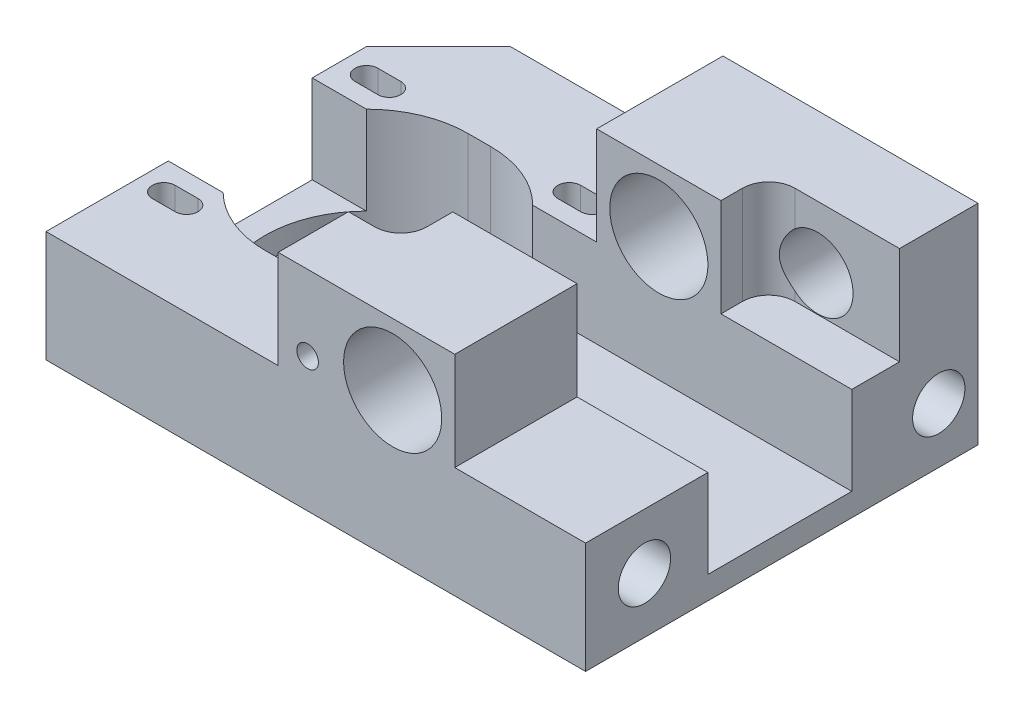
ISO-10303-21;
HEADER;
FILE_DESCRIPTION(('STEP AP214'),'2;1');
FILE_NAME('part.step','',(''),(''),'','','');
FILE_SCHEMA(('AUTOMOTIVE_DESIGN { 1 0 10303 214 1 1 1 1 }'));
ENDSEC;
DATA;
#1=APPLICATION_CONTEXT('core data for automotive mechanical design processes');
#2=APPLICATION_PROTOCOL_DEFINITION('international standard','automotive_design',2000,#1);
#3=PRODUCT_CONTEXT('',#1,'mechanical');
#4=PRODUCT('Part','Part','',(#3));
#5=PRODUCT_RELATED_PRODUCT_CATEGORY('part','',(#4));
#6=PRODUCT_DEFINITION_FORMATION('','',#4);
#7=PRODUCT_DEFINITION_CONTEXT('part definition',#1,'design');
#8=PRODUCT_DEFINITION('design','',#6,#7);
#9=PRODUCT_DEFINITION_SHAPE('','',#8);
#10=(LENGTH_UNIT() NAMED_UNIT(*) SI_UNIT(.MILLI.,.METRE.));
#11=(NAMED_UNIT(*) PLANE_ANGLE_UNIT() SI_UNIT($,.RADIAN.));
#12=(NAMED_UNIT(*) SI_UNIT($,.STERADIAN.) SOLID_ANGLE_UNIT());
#13=UNCERTAINTY_MEASURE_WITH_UNIT(LENGTH_MEASURE(1.E-05),#10,'distance_accuracy_value','');
#14=(GEOMETRIC_REPRESENTATION_CONTEXT(3) GLOBAL_UNCERTAINTY_ASSIGNED_CONTEXT((#13)) GLOBAL_UNIT_ASSIGNED_CONTEXT((#10,
#11,#12)) REPRESENTATION_CONTEXT('',''));
#15=CARTESIAN_POINT('',(0.,0.,0.));
#16=DIRECTION('',(0.,0.,1.));
#17=DIRECTION('',(1.,0.,0.));
#18=AXIS2_PLACEMENT_3D('',#15,#16,#17);
#19=CARTESIAN_POINT('',(0.,32.,0.));
#20=DIRECTION('',(0.,-1.,0.));
#21=DIRECTION('',(0.,0.,-1.));
#22=AXIS2_PLACEMENT_3D('',#19,#20,#21);
#23=PLANE('',#22);
#24=DIRECTION('',(0.,0.,1.));
#25=VECTOR('',#24,1.);
#26=CARTESIAN_POINT('',(62.5,32.,0.));
#27=LINE('',#26,#25);
#28=CARTESIAN_POINT('',(62.5,32.,-18.7));
#29=VERTEX_POINT('',#28);
#30=CARTESIAN_POINT('',(62.5,32.,0.));
#31=VERTEX_POINT('',#30);
#32=EDGE_CURVE('E474',#29,#31,#27,.T.);
#33=ORIENTED_EDGE('',*,*,#32,.F.);
#34=DIRECTION('',(-1.,0.,0.));
#35=VECTOR('',#34,1.);
#36=CARTESIAN_POINT('',(0.,32.,-18.7));
#37=LINE('',#36,#35);
#38=CARTESIAN_POINT('',(43.5,32.,-18.7));
#39=VERTEX_POINT('',#38);
#40=EDGE_CURVE('E406',#29,#39,#37,.T.);
#41=ORIENTED_EDGE('',*,*,#40,.T.);
#42=DIRECTION('',(0.,0.,-1.));
#43=VECTOR('',#42,1.);
#44=CARTESIAN_POINT('',(43.5,32.,-60.));
#45=LINE('',#44,#43);
#46=CARTESIAN_POINT('',(43.5,32.,-14.75));
#47=VERTEX_POINT('',#46);
#48=EDGE_CURVE('E522',#47,#39,#45,.T.);
#49=ORIENTED_EDGE('',*,*,#48,.F.);
#50=CARTESIAN_POINT('',(39.5,32.,-14.75));
#51=DIRECTION('',(0.,1.,0.));
#52=DIRECTION('',(0.,0.,-1.));
#53=AXIS2_PLACEMENT_3D('',#50,#51,#52);
#54=CIRCLE('',#53,4.);
#55=CARTESIAN_POINT('',(39.5,32.,-10.75));
#56=VERTEX_POINT('',#55);
#57=EDGE_CURVE('E518',#56,#47,#54,.T.);
#58=ORIENTED_EDGE('',*,*,#57,.F.);
#59=DIRECTION('',(1.,0.,0.));
#60=VECTOR('',#59,1.);
#61=CARTESIAN_POINT('',(39.5,32.,-10.75));
#62=LINE('',#61,#60);
#63=CARTESIAN_POINT('',(35.5,32.,-10.75));
#64=VERTEX_POINT('',#63);
#65=EDGE_CURVE('E515',#64,#56,#62,.T.);
#66=ORIENTED_EDGE('',*,*,#65,.F.);
#67=DIRECTION('',(0.,0.,-1.));
#68=VECTOR('',#67,1.);
#69=CARTESIAN_POINT('',(35.5,32.,-10.75));
#70=LINE('',#69,#68);
#71=CARTESIAN_POINT('',(35.5,32.,0.));
#72=VERTEX_POINT('',#71);
#73=EDGE_CURVE('E481',#72,#64,#70,.T.);
#74=ORIENTED_EDGE('',*,*,#73,.F.);
#75=DIRECTION('',(1.,0.,0.));
#76=VECTOR('',#75,1.);
#77=CARTESIAN_POINT('',(82.5,32.,0.));
#78=LINE('',#77,#76);
#79=EDGE_CURVE('E680',#72,#31,#78,.T.);
#80=ORIENTED_EDGE('',*,*,#79,.T.);
#81=EDGE_LOOP('',(#33,#41,#49,#58,#66,#74,#80));
#82=FACE_BOUND('',#81,.T.);
#83=ADVANCED_FACE('F34',(#82),#23,.F.);
#84=CARTESIAN_POINT('',(43.5,17.,-60.));
#85=DIRECTION('',(1.,0.,0.));
#86=DIRECTION('',(0.,0.,-1.));
#87=AXIS2_PLACEMENT_3D('',#84,#85,#86);
#88=PLANE('',#87);
#89=ORIENTED_EDGE('',*,*,#48,.T.);
#90=DIRECTION('',(0.,-1.,0.));
#91=VECTOR('',#90,1.);
#92=CARTESIAN_POINT('',(43.5,17.,-18.7));
#93=LINE('',#92,#91);
#94=CARTESIAN_POINT('',(43.5,17.,-18.7));
#95=VERTEX_POINT('',#94);
#96=EDGE_CURVE('E409',#39,#95,#93,.T.);
#97=ORIENTED_EDGE('',*,*,#96,.T.);
#98=DIRECTION('',(0.,0.,-1.));
#99=VECTOR('',#98,1.);
#100=CARTESIAN_POINT('',(43.5,17.,-60.));
#101=LINE('',#100,#99);
#102=CARTESIAN_POINT('',(43.5,17.,-14.75));
#103=VERTEX_POINT('',#102);
#104=EDGE_CURVE('E505',#103,#95,#101,.T.);
#105=ORIENTED_EDGE('',*,*,#104,.F.);
#106=DIRECTION('',(0.,1.,0.));
#107=VECTOR('',#106,1.);
#108=CARTESIAN_POINT('',(43.5,17.,-14.75));
#109=LINE('',#108,#107);
#110=EDGE_CURVE('E529',#103,#47,#109,.T.);
#111=ORIENTED_EDGE('',*,*,#110,.T.);
#112=EDGE_LOOP('',(#89,#97,#105,#111));
#113=FACE_BOUND('',#112,.T.);
#114=ADVANCED_FACE('F767',(#113),#88,.F.);
#115=CARTESIAN_POINT('',(39.5,17.,-14.75));
#116=DIRECTION('',(0.,-1.,0.));
#117=DIRECTION('',(0.,0.,-1.));
#118=AXIS2_PLACEMENT_3D('',#115,#116,#117);
#119=PLANE('',#118);
#120=CARTESIAN_POINT('',(3.75000000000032,17.,-14.25));
#121=DIRECTION('',(0.,-1.,0.));
#122=DIRECTION('',(0.,0.,-1.));
#123=AXIS2_PLACEMENT_3D('',#120,#121,#122);
#124=CIRCLE('',#123,1.75000000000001);
#125=CARTESIAN_POINT('',(3.75000000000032,17.,-12.5));
#126=VERTEX_POINT('',#125);
#127=CARTESIAN_POINT('',(3.75000000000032,17.,-16.));
#128=VERTEX_POINT('',#127);
#129=EDGE_CURVE('E553',#126,#128,#124,.T.);
#130=ORIENTED_EDGE('',*,*,#129,.T.);
#131=DIRECTION('',(1.,0.,0.));
#132=VECTOR('',#131,1.);
#133=CARTESIAN_POINT('',(3.75000000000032,17.,-16.));
#134=LINE('',#133,#132);
#135=CARTESIAN_POINT('',(7.25000000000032,17.,-16.));
#136=VERTEX_POINT('',#135);
#137=EDGE_CURVE('E547',#128,#136,#134,.T.);
#138=ORIENTED_EDGE('',*,*,#137,.T.);
#139=CARTESIAN_POINT('',(7.25000000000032,17.,-14.25));
#140=DIRECTION('',(0.,-1.,0.));
#141=DIRECTION('',(0.,0.,-1.));
#142=AXIS2_PLACEMENT_3D('',#139,#140,#141);
#143=CIRCLE('',#142,1.75000000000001);
#144=CARTESIAN_POINT('',(7.25000000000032,17.,-12.5));
#145=VERTEX_POINT('',#144);
#146=EDGE_CURVE('E549',#136,#145,#143,.T.);
#147=ORIENTED_EDGE('',*,*,#146,.T.);
#148=DIRECTION('',(-1.,0.,0.));
#149=VECTOR('',#148,1.);
#150=CARTESIAN_POINT('',(3.75000000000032,17.,-12.5));
#151=LINE('',#150,#149);
#152=EDGE_CURVE('E551',#145,#126,#151,.T.);
#153=ORIENTED_EDGE('',*,*,#152,.T.);
#154=EDGE_LOOP('',(#130,#138,#147,#153));
#155=FACE_BOUND('',#154,.T.);
#156=CARTESIAN_POINT('',(34.7500000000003,17.,-14.25));
#157=DIRECTION('',(0.,-1.,0.));
#158=DIRECTION('',(0.,0.,-1.));
#159=AXIS2_PLACEMENT_3D('',#156,#157,#158);
#160=CIRCLE('',#159,1.75000000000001);
#161=CARTESIAN_POINT('',(34.7500000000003,17.,-12.5));
#162=VERTEX_POINT('',#161);
#163=CARTESIAN_POINT('',(34.7500000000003,17.,-16.));
#164=VERTEX_POINT('',#163);
#165=EDGE_CURVE('E561',#162,#164,#160,.T.);
#166=ORIENTED_EDGE('',*,*,#165,.T.);
#167=DIRECTION('',(1.,0.,0.));
#168=VECTOR('',#167,1.);
#169=CARTESIAN_POINT('',(34.7500000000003,17.,-16.));
#170=LINE('',#169,#168);
#171=CARTESIAN_POINT('',(38.2500000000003,17.,-16.));
#172=VERTEX_POINT('',#171);
#173=EDGE_CURVE('E555',#164,#172,#170,.T.);
#174=ORIENTED_EDGE('',*,*,#173,.T.);
#175=CARTESIAN_POINT('',(38.2500000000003,17.,-14.25));
#176=DIRECTION('',(0.,-1.,0.));
#177=DIRECTION('',(0.,0.,-1.));
#178=AXIS2_PLACEMENT_3D('',#175,#176,#177);
#179=CIRCLE('',#178,1.75000000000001);
#180=CARTESIAN_POINT('',(38.2500000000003,17.,-12.5));
#181=VERTEX_POINT('',#180);
#182=EDGE_CURVE('E557',#172,#181,#179,.T.);
#183=ORIENTED_EDGE('',*,*,#182,.T.);
#184=DIRECTION('',(-1.,0.,0.));
#185=VECTOR('',#184,1.);
#186=CARTESIAN_POINT('',(34.7500000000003,17.,-12.5));
#187=LINE('',#186,#185);
#188=EDGE_CURVE('E559',#181,#162,#187,.T.);
#189=ORIENTED_EDGE('',*,*,#188,.T.);
#190=EDGE_LOOP('',(#166,#174,#183,#189));
#191=FACE_BOUND('',#190,.T.);
#192=ORIENTED_EDGE('',*,*,#104,.T.);
#193=DIRECTION('',(-1.,0.,0.));
#194=VECTOR('',#193,1.);
#195=CARTESIAN_POINT('',(39.5,17.,-18.7));
#196=LINE('',#195,#194);
#197=CARTESIAN_POINT('',(33.6195676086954,17.,-18.7));
#198=VERTEX_POINT('',#197);
#199=EDGE_CURVE('E412',#95,#198,#196,.T.);
#200=ORIENTED_EDGE('',*,*,#199,.T.);
#201=CARTESIAN_POINT('',(22.75,17.,-29.75));
#202=DIRECTION('',(0.,-1.,0.));
#203=DIRECTION('',(0.,0.,-1.));
#204=AXIS2_PLACEMENT_3D('',#201,#202,#203);
#205=CIRCLE('',#204,15.5);
#206=CARTESIAN_POINT('',(22.75,17.,-14.25));
#207=VERTEX_POINT('',#206);
#208=EDGE_CURVE('E528',#198,#207,#205,.T.);
#209=ORIENTED_EDGE('',*,*,#208,.T.);
#210=DIRECTION('',(-1.,0.,0.));
#211=VECTOR('',#210,1.);
#212=CARTESIAN_POINT('',(19.25,17.,-14.25));
#213=LINE('',#212,#211);
#214=CARTESIAN_POINT('',(19.25,17.,-14.25));
#215=VERTEX_POINT('',#214);
#216=EDGE_CURVE('E541',#207,#215,#213,.T.);
#217=ORIENTED_EDGE('',*,*,#216,.T.);
#218=CARTESIAN_POINT('',(19.25,17.,-29.75));
#219=DIRECTION('',(0.,-1.,0.));
#220=DIRECTION('',(0.,0.,-1.));
#221=AXIS2_PLACEMENT_3D('',#218,#219,#220);
#222=CIRCLE('',#221,15.5);
#223=CARTESIAN_POINT('',(8.38043239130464,17.,-18.7));
#224=VERTEX_POINT('',#223);
#225=EDGE_CURVE('E544',#215,#224,#222,.T.);
#226=ORIENTED_EDGE('',*,*,#225,.T.);
#227=CARTESIAN_POINT('',(0.,17.,-18.7));
#228=VERTEX_POINT('',#227);
#229=EDGE_CURVE('E416',#224,#228,#196,.T.);
#230=ORIENTED_EDGE('',*,*,#229,.T.);
#231=DIRECTION('',(0.,0.,1.));
#232=VECTOR('',#231,1.);
#233=CARTESIAN_POINT('',(0.,17.,0.));
#234=LINE('',#233,#232);
#235=CARTESIAN_POINT('',(0.,17.,0.));
#236=VERTEX_POINT('',#235);
#237=EDGE_CURVE('E369',#228,#236,#234,.T.);
#238=ORIENTED_EDGE('',*,*,#237,.T.);
#239=DIRECTION('',(1.,0.,0.));
#240=VECTOR('',#239,1.);
#241=CARTESIAN_POINT('',(35.5,17.,0.));
#242=LINE('',#241,#240);
#243=CARTESIAN_POINT('',(35.5,17.,0.));
#244=VERTEX_POINT('',#243);
#245=EDGE_CURVE('E492',#236,#244,#242,.T.);
#246=ORIENTED_EDGE('',*,*,#245,.T.);
#247=DIRECTION('',(0.,0.,-1.));
#248=VECTOR('',#247,1.);
#249=CARTESIAN_POINT('',(35.5,17.,-10.75));
#250=LINE('',#249,#248);
#251=CARTESIAN_POINT('',(35.5,17.,-10.75));
#252=VERTEX_POINT('',#251);
#253=EDGE_CURVE('E495',#244,#252,#250,.T.);
#254=ORIENTED_EDGE('',*,*,#253,.T.);
#255=DIRECTION('',(1.,0.,0.));
#256=VECTOR('',#255,1.);
#257=CARTESIAN_POINT('',(39.5,17.,-10.75));
#258=LINE('',#257,#256);
#259=CARTESIAN_POINT('',(39.5,17.,-10.75));
#260=VERTEX_POINT('',#259);
#261=EDGE_CURVE('E498',#252,#260,#258,.T.);
#262=ORIENTED_EDGE('',*,*,#261,.T.);
#263=CARTESIAN_POINT('',(39.5,17.,-14.75));
#264=DIRECTION('',(0.,1.,0.));
#265=DIRECTION('',(0.,0.,-1.));
#266=AXIS2_PLACEMENT_3D('',#263,#264,#265);
#267=CIRCLE('',#266,4.);
#268=EDGE_CURVE('E501',#260,#103,#267,.T.);
#269=ORIENTED_EDGE('',*,*,#268,.T.);
#270=EDGE_LOOP('',(#192,#200,#209,#217,#226,#230,#238,#246,#254,#262,#269));
#271=FACE_BOUND('',#270,.T.);
#272=ADVANCED_FACE('F763',(#155,#191,#271),#119,.F.);
#273=CARTESIAN_POINT('',(62.5,17.,0.));
#274=DIRECTION('',(-1.,0.,0.));
#275=DIRECTION('',(0.,0.,1.));
#276=AXIS2_PLACEMENT_3D('',#273,#274,#275);
#277=PLANE('',#276);
#278=DIRECTION('',(0.,0.,1.));
#279=VECTOR('',#278,1.);
#280=CARTESIAN_POINT('',(62.5,17.,0.));
#281=LINE('',#280,#279);
#282=CARTESIAN_POINT('',(62.5,17.,-18.7));
#283=VERTEX_POINT('',#282);
#284=CARTESIAN_POINT('',(62.5,17.,0.));
#285=VERTEX_POINT('',#284);
#286=EDGE_CURVE('E462',#283,#285,#281,.T.);
#287=ORIENTED_EDGE('',*,*,#286,.F.);
#288=DIRECTION('',(0.,1.,0.));
#289=VECTOR('',#288,1.);
#290=CARTESIAN_POINT('',(62.5,17.,-18.7));
#291=LINE('',#290,#289);
#292=EDGE_CURVE('E403',#283,#29,#291,.T.);
#293=ORIENTED_EDGE('',*,*,#292,.T.);
#294=ORIENTED_EDGE('',*,*,#32,.T.);
#295=DIRECTION('',(0.,1.,0.));
#296=VECTOR('',#295,1.);
#297=CARTESIAN_POINT('',(62.5,17.,0.));
#298=LINE('',#297,#296);
#299=EDGE_CURVE('E478',#285,#31,#298,.T.);
#300=ORIENTED_EDGE('',*,*,#299,.F.);
#301=EDGE_LOOP('',(#287,#293,#294,#300));
#302=FACE_BOUND('',#301,.T.);
#303=ADVANCED_FACE('F754',(#302),#277,.F.);
#304=CARTESIAN_POINT('',(66.5,17.,-44.));
#305=DIRECTION('',(0.,1.,0.));
#306=DIRECTION('',(0.,0.,1.));
#307=AXIS2_PLACEMENT_3D('',#304,#305,#306);
#308=PLANE('',#307);
#309=DIRECTION('',(1.,0.,0.));
#310=VECTOR('',#309,1.);
#311=CARTESIAN_POINT('',(66.5,17.,-18.7));
#312=LINE('',#311,#310);
#313=CARTESIAN_POINT('',(82.5,17.,-18.7));
#314=VERTEX_POINT('',#313);
#315=EDGE_CURVE('E401',#283,#314,#312,.T.);
#316=ORIENTED_EDGE('',*,*,#315,.F.);
#317=ORIENTED_EDGE('',*,*,#286,.T.);
#318=DIRECTION('',(1.,0.,0.));
#319=VECTOR('',#318,1.);
#320=CARTESIAN_POINT('',(82.5,17.,0.));
#321=LINE('',#320,#319);
#322=CARTESIAN_POINT('',(82.5,17.,0.));
#323=VERTEX_POINT('',#322);
#324=EDGE_CURVE('E466',#285,#323,#321,.T.);
#325=ORIENTED_EDGE('',*,*,#324,.T.);
#326=DIRECTION('',(0.,0.,-1.));
#327=VECTOR('',#326,1.);
#328=CARTESIAN_POINT('',(82.5,17.,-48.));
#329=LINE('',#328,#327);
#330=EDGE_CURVE('E452',#323,#314,#329,.T.);
#331=ORIENTED_EDGE('',*,*,#330,.T.);
#332=EDGE_LOOP('',(#316,#317,#325,#331));
#333=FACE_BOUND('',#332,.T.);
#334=ADVANCED_FACE('F749',(#333),#308,.T.);
#335=CARTESIAN_POINT('',(53.,22.5,0.));
#336=DIRECTION('',(0.,0.,-1.));
#337=DIRECTION('',(-1.,0.,0.));
#338=AXIS2_PLACEMENT_3D('',#335,#336,#337);
#339=CYLINDRICAL_SURFACE('',#338,7.5);
#340=CARTESIAN_POINT('',(53.,22.5,-18.7));
#341=DIRECTION('',(0.,0.,1.));
#342=DIRECTION('',(1.,0.,0.));
#343=AXIS2_PLACEMENT_3D('',#340,#341,#342);
#344=CIRCLE('',#343,7.5);
#345=CARTESIAN_POINT('',(60.5,22.5,-18.7));
#346=VERTEX_POINT('',#345);
#347=EDGE_CURVE('E400',#346,#346,#344,.F.);
#348=ORIENTED_EDGE('',*,*,#347,.T.);
#349=EDGE_LOOP('',(#348));
#350=FACE_BOUND('',#349,.T.);
#351=CARTESIAN_POINT('',(53.,22.5,0.));
#352=DIRECTION('',(0.,0.,-1.));
#353=DIRECTION('',(-1.,0.,0.));
#354=AXIS2_PLACEMENT_3D('',#351,#352,#353);
#355=CIRCLE('',#354,7.5);
#356=CARTESIAN_POINT('',(45.5,22.5,0.));
#357=VERTEX_POINT('',#356);
#358=EDGE_CURVE('E446',#357,#357,#355,.T.);
#359=ORIENTED_EDGE('',*,*,#358,.F.);
#360=EDGE_LOOP('',(#359));
#361=FACE_BOUND('',#360,.T.);
#362=ADVANCED_FACE('F745',(#350,#361),#339,.F.);
#363=CARTESIAN_POINT('',(43.5,32.,-40.7));
#364=VERTEX_POINT('',#363);
#365=CARTESIAN_POINT('',(43.5,32.,-60.));
#366=VERTEX_POINT('',#365);
#367=EDGE_CURVE('E521',#364,#366,#45,.T.);
#368=ORIENTED_EDGE('',*,*,#367,.F.);
#369=DIRECTION('',(1.,0.,0.));
#370=VECTOR('',#369,1.);
#371=CARTESIAN_POINT('',(0.,32.,-40.7));
#372=LINE('',#371,#370);
#373=CARTESIAN_POINT('',(62.5,32.,-40.7));
#374=VERTEX_POINT('',#373);
#375=EDGE_CURVE('E387',#364,#374,#372,.T.);
#376=ORIENTED_EDGE('',*,*,#375,.T.);
#377=CARTESIAN_POINT('',(62.5,32.,-44.));
#378=VERTEX_POINT('',#377);
#379=EDGE_CURVE('E475',#378,#374,#27,.T.);
#380=ORIENTED_EDGE('',*,*,#379,.F.);
#381=CARTESIAN_POINT('',(66.5,32.,-44.));
#382=DIRECTION('',(0.,1.,0.));
#383=DIRECTION('',(0.,0.,1.));
#384=AXIS2_PLACEMENT_3D('',#381,#382,#383);
#385=CIRCLE('',#384,4.);
#386=CARTESIAN_POINT('',(66.5,32.,-48.));
#387=VERTEX_POINT('',#386);
#388=EDGE_CURVE('E471',#387,#378,#385,.T.);
#389=ORIENTED_EDGE('',*,*,#388,.F.);
#390=DIRECTION('',(-1.,0.,0.));
#391=VECTOR('',#390,1.);
#392=CARTESIAN_POINT('',(66.5,32.,-48.));
#393=LINE('',#392,#391);
#394=CARTESIAN_POINT('',(82.5,32.,-48.));
#395=VERTEX_POINT('',#394);
#396=EDGE_CURVE('E449',#395,#387,#393,.T.);
#397=ORIENTED_EDGE('',*,*,#396,.F.);
#398=DIRECTION('',(0.,0.,-1.));
#399=VECTOR('',#398,1.);
#400=CARTESIAN_POINT('',(82.5,32.,-60.));
#401=LINE('',#400,#399);
#402=CARTESIAN_POINT('',(82.5,32.,-60.));
#403=VERTEX_POINT('',#402);
#404=EDGE_CURVE('E683',#395,#403,#401,.T.);
#405=ORIENTED_EDGE('',*,*,#404,.T.);
#406=DIRECTION('',(-1.,0.,0.));
#407=VECTOR('',#406,1.);
#408=CARTESIAN_POINT('',(11.,32.,-60.));
#409=LINE('',#408,#407);
#410=EDGE_CURVE('E686',#403,#366,#409,.T.);
#411=ORIENTED_EDGE('',*,*,#410,.T.);
#412=EDGE_LOOP('',(#368,#376,#380,#389,#397,#405,#411));
#413=FACE_BOUND('',#412,.T.);
#414=ADVANCED_FACE('F770',(#413),#23,.F.);
#415=CARTESIAN_POINT('',(0.,0.,0.));
#416=DIRECTION('',(0.,-1.,0.));
#417=DIRECTION('',(0.,0.,-1.));
#418=AXIS2_PLACEMENT_3D('',#415,#416,#417);
#419=PLANE('',#418);
#420=DIRECTION('',(-1.,0.,0.));
#421=VECTOR('',#420,1.);
#422=CARTESIAN_POINT('',(3.75000000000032,0.,-16.));
#423=LINE('',#422,#421);
#424=CARTESIAN_POINT('',(7.25000000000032,0.,-16.));
#425=VERTEX_POINT('',#424);
#426=CARTESIAN_POINT('',(3.75000000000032,0.,-16.));
#427=VERTEX_POINT('',#426);
#428=EDGE_CURVE('E608',#425,#427,#423,.T.);
#429=ORIENTED_EDGE('',*,*,#428,.T.);
#430=CARTESIAN_POINT('',(3.75000000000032,0.,-14.25));
#431=DIRECTION('',(0.,1.,0.));
#432=DIRECTION('',(0.,0.,1.));
#433=AXIS2_PLACEMENT_3D('',#430,#431,#432);
#434=CIRCLE('',#433,1.75000000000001);
#435=CARTESIAN_POINT('',(3.75000000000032,0.,-12.5));
#436=VERTEX_POINT('',#435);
#437=EDGE_CURVE('E599',#427,#436,#434,.T.);
#438=ORIENTED_EDGE('',*,*,#437,.T.);
#439=DIRECTION('',(1.,0.,0.));
#440=VECTOR('',#439,1.);
#441=CARTESIAN_POINT('',(3.75000000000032,0.,-12.5));
#442=LINE('',#441,#440);
#443=CARTESIAN_POINT('',(7.25000000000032,0.,-12.5));
#444=VERTEX_POINT('',#443);
#445=EDGE_CURVE('E602',#436,#444,#442,.T.);
#446=ORIENTED_EDGE('',*,*,#445,.T.);
#447=CARTESIAN_POINT('',(7.25000000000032,0.,-14.25));
#448=DIRECTION('',(0.,1.,0.));
#449=DIRECTION('',(0.,0.,-1.));
#450=AXIS2_PLACEMENT_3D('',#447,#448,#449);
#451=CIRCLE('',#450,1.75000000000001);
#452=EDGE_CURVE('E605',#444,#425,#451,.T.);
#453=ORIENTED_EDGE('',*,*,#452,.T.);
#454=EDGE_LOOP('',(#429,#438,#446,#453));
#455=FACE_BOUND('',#454,.T.);
#456=DIRECTION('',(-1.,0.,0.));
#457=VECTOR('',#456,1.);
#458=CARTESIAN_POINT('',(34.75,0.,-47.));
#459=LINE('',#458,#457);
#460=CARTESIAN_POINT('',(38.25,0.,-47.));
#461=VERTEX_POINT('',#460);
#462=CARTESIAN_POINT('',(34.75,0.,-47.));
#463=VERTEX_POINT('',#462);
#464=EDGE_CURVE('E648',#461,#463,#459,.T.);
#465=ORIENTED_EDGE('',*,*,#464,.T.);
#466=CARTESIAN_POINT('',(34.75,0.,-45.25));
#467=DIRECTION('',(0.,1.,0.));
#468=DIRECTION('',(0.,0.,1.));
#469=AXIS2_PLACEMENT_3D('',#466,#467,#468);
#470=CIRCLE('',#469,1.75000000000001);
#471=CARTESIAN_POINT('',(34.75,0.,-43.5));
#472=VERTEX_POINT('',#471);
#473=EDGE_CURVE('E639',#463,#472,#470,.T.);
#474=ORIENTED_EDGE('',*,*,#473,.T.);
#475=DIRECTION('',(1.,0.,0.));
#476=VECTOR('',#475,1.);
#477=CARTESIAN_POINT('',(34.75,0.,-43.5));
#478=LINE('',#477,#476);
#479=CARTESIAN_POINT('',(38.25,0.,-43.5));
#480=VERTEX_POINT('',#479);
#481=EDGE_CURVE('E642',#472,#480,#478,.T.);
#482=ORIENTED_EDGE('',*,*,#481,.T.);
#483=CARTESIAN_POINT('',(38.25,0.,-45.25));
#484=DIRECTION('',(0.,1.,0.));
#485=DIRECTION('',(0.,0.,-1.));
#486=AXIS2_PLACEMENT_3D('',#483,#484,#485);
#487=CIRCLE('',#486,1.75000000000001);
#488=EDGE_CURVE('E645',#480,#461,#487,.T.);
#489=ORIENTED_EDGE('',*,*,#488,.T.);
#490=EDGE_LOOP('',(#465,#474,#482,#489));
#491=FACE_BOUND('',#490,.T.);
#492=DIRECTION('',(1.,0.,0.));
#493=VECTOR('',#492,1.);
#494=CARTESIAN_POINT('',(82.5,0.,0.));
#495=LINE('',#494,#493);
#496=CARTESIAN_POINT('',(0.,0.,0.));
#497=VERTEX_POINT('',#496);
#498=CARTESIAN_POINT('',(82.5,0.,0.));
#499=VERTEX_POINT('',#498);
#500=EDGE_CURVE('E679',#497,#499,#495,.T.);
#501=ORIENTED_EDGE('',*,*,#500,.F.);
#502=DIRECTION('',(0.,0.,1.));
#503=VECTOR('',#502,1.);
#504=CARTESIAN_POINT('',(0.,0.,0.));
#505=LINE('',#504,#503);
#506=CARTESIAN_POINT('',(0.,0.,-49.));
#507=VERTEX_POINT('',#506);
#508=EDGE_CURVE('E684',#507,#497,#505,.T.);
#509=ORIENTED_EDGE('',*,*,#508,.F.);
#510=DIRECTION('',(-0.707106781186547,0.,0.707106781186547));
#511=VECTOR('',#510,1.);
#512=CARTESIAN_POINT('',(0.,0.,-49.));
#513=LINE('',#512,#511);
#514=CARTESIAN_POINT('',(11.,0.,-60.));
#515=VERTEX_POINT('',#514);
#516=EDGE_CURVE('E697',#515,#507,#513,.T.);
#517=ORIENTED_EDGE('',*,*,#516,.F.);
#518=DIRECTION('',(-1.,0.,0.));
#519=VECTOR('',#518,1.);
#520=CARTESIAN_POINT('',(11.,0.,-60.));
#521=LINE('',#520,#519);
#522=CARTESIAN_POINT('',(82.5,0.,-60.));
#523=VERTEX_POINT('',#522);
#524=EDGE_CURVE('E694',#523,#515,#521,.T.);
#525=ORIENTED_EDGE('',*,*,#524,.F.);
#526=DIRECTION('',(0.,0.,-1.));
#527=VECTOR('',#526,1.);
#528=CARTESIAN_POINT('',(82.5,0.,-60.));
#529=LINE('',#528,#527);
#530=EDGE_CURVE('E692',#499,#523,#529,.T.);
#531=ORIENTED_EDGE('',*,*,#530,.F.);
#532=EDGE_LOOP('',(#501,#509,#517,#525,#531));
#533=FACE_BOUND('',#532,.T.);
#534=DIRECTION('',(-1.,0.,0.));
#535=VECTOR('',#534,1.);
#536=CARTESIAN_POINT('',(3.75,0.,-47.));
#537=LINE('',#536,#535);
#538=CARTESIAN_POINT('',(7.25,0.,-47.));
#539=VERTEX_POINT('',#538);
#540=CARTESIAN_POINT('',(3.75,0.,-47.));
#541=VERTEX_POINT('',#540);
#542=EDGE_CURVE('E668',#539,#541,#537,.T.);
#543=ORIENTED_EDGE('',*,*,#542,.T.);
#544=CARTESIAN_POINT('',(3.75,0.,-45.25));
#545=DIRECTION('',(0.,1.,0.));
#546=DIRECTION('',(0.,0.,1.));
#547=AXIS2_PLACEMENT_3D('',#544,#545,#546);
#548=CIRCLE('',#547,1.75000000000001);
#549=CARTESIAN_POINT('',(3.75,0.,-43.5));
#550=VERTEX_POINT('',#549);
#551=EDGE_CURVE('E659',#541,#550,#548,.T.);
#552=ORIENTED_EDGE('',*,*,#551,.T.);
#553=DIRECTION('',(1.,0.,0.));
#554=VECTOR('',#553,1.);
#555=CARTESIAN_POINT('',(3.75,0.,-43.5));
#556=LINE('',#555,#554);
#557=CARTESIAN_POINT('',(7.25,0.,-43.5));
#558=VERTEX_POINT('',#557);
#559=EDGE_CURVE('E662',#550,#558,#556,.T.);
#560=ORIENTED_EDGE('',*,*,#559,.T.);
#561=CARTESIAN_POINT('',(7.25,0.,-45.25));
#562=DIRECTION('',(0.,1.,0.));
#563=DIRECTION('',(0.,0.,-1.));
#564=AXIS2_PLACEMENT_3D('',#561,#562,#563);
#565=CIRCLE('',#564,1.75000000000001);
#566=EDGE_CURVE('E665',#558,#539,#565,.T.);
#567=ORIENTED_EDGE('',*,*,#566,.T.);
#568=EDGE_LOOP('',(#543,#552,#560,#567));
#569=FACE_BOUND('',#568,.T.);
#570=DIRECTION('',(-1.,0.,0.));
#571=VECTOR('',#570,1.);
#572=CARTESIAN_POINT('',(34.7500000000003,0.,-16.));
#573=LINE('',#572,#571);
#574=CARTESIAN_POINT('',(38.2500000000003,0.,-16.));
#575=VERTEX_POINT('',#574);
#576=CARTESIAN_POINT('',(34.7500000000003,0.,-16.));
#577=VERTEX_POINT('',#576);
#578=EDGE_CURVE('E628',#575,#577,#573,.T.);
#579=ORIENTED_EDGE('',*,*,#578,.T.);
#580=CARTESIAN_POINT('',(34.7500000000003,0.,-14.25));
#581=DIRECTION('',(0.,1.,0.));
#582=DIRECTION('',(0.,0.,1.));
#583=AXIS2_PLACEMENT_3D('',#580,#581,#582);
#584=CIRCLE('',#583,1.75000000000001);
#585=CARTESIAN_POINT('',(34.7500000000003,0.,-12.5));
#586=VERTEX_POINT('',#585);
#587=EDGE_CURVE('E619',#577,#586,#584,.T.);
#588=ORIENTED_EDGE('',*,*,#587,.T.);
#589=DIRECTION('',(1.,0.,0.));
#590=VECTOR('',#589,1.);
#591=CARTESIAN_POINT('',(34.7500000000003,0.,-12.5));
#592=LINE('',#591,#590);
#593=CARTESIAN_POINT('',(38.2500000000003,0.,-12.5));
#594=VERTEX_POINT('',#593);
#595=EDGE_CURVE('E622',#586,#594,#592,.T.);
#596=ORIENTED_EDGE('',*,*,#595,.T.);
#597=CARTESIAN_POINT('',(38.2500000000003,0.,-14.25));
#598=DIRECTION('',(0.,1.,0.));
#599=DIRECTION('',(0.,0.,-1.));
#600=AXIS2_PLACEMENT_3D('',#597,#598,#599);
#601=CIRCLE('',#600,1.75000000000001);
#602=EDGE_CURVE('E625',#594,#575,#601,.T.);
#603=ORIENTED_EDGE('',*,*,#602,.T.);
#604=EDGE_LOOP('',(#579,#588,#596,#603));
#605=FACE_BOUND('',#604,.T.);
#606=DIRECTION('',(-1.,0.,0.));
#607=VECTOR('',#606,1.);
#608=CARTESIAN_POINT('',(19.25,0.,-45.25));
#609=LINE('',#608,#607);
#610=CARTESIAN_POINT('',(22.75,0.,-45.25));
#611=VERTEX_POINT('',#610);
#612=CARTESIAN_POINT('',(19.25,0.,-45.25));
#613=VERTEX_POINT('',#612);
#614=EDGE_CURVE('E588',#611,#613,#609,.T.);
#615=ORIENTED_EDGE('',*,*,#614,.T.);
#616=CARTESIAN_POINT('',(19.25,0.,-29.75));
#617=DIRECTION('',(0.,1.,0.));
#618=DIRECTION('',(0.,0.,1.));
#619=AXIS2_PLACEMENT_3D('',#616,#617,#618);
#620=CIRCLE('',#619,15.5);
#621=CARTESIAN_POINT('',(19.25,0.,-14.25));
#622=VERTEX_POINT('',#621);
#623=EDGE_CURVE('E579',#613,#622,#620,.T.);
#624=ORIENTED_EDGE('',*,*,#623,.T.);
#625=DIRECTION('',(1.,0.,0.));
#626=VECTOR('',#625,1.);
#627=CARTESIAN_POINT('',(19.25,0.,-14.25));
#628=LINE('',#627,#626);
#629=CARTESIAN_POINT('',(22.75,0.,-14.25));
#630=VERTEX_POINT('',#629);
#631=EDGE_CURVE('E582',#622,#630,#628,.T.);
#632=ORIENTED_EDGE('',*,*,#631,.T.);
#633=CARTESIAN_POINT('',(22.75,0.,-29.75));
#634=DIRECTION('',(0.,1.,0.));
#635=DIRECTION('',(0.,0.,1.));
#636=AXIS2_PLACEMENT_3D('',#633,#634,#635);
#637=CIRCLE('',#636,15.5);
#638=EDGE_CURVE('E585',#630,#611,#637,.T.);
#639=ORIENTED_EDGE('',*,*,#638,.T.);
#640=EDGE_LOOP('',(#615,#624,#632,#639));
#641=FACE_BOUND('',#640,.T.);
#642=ADVANCED_FACE('F781',(#455,#491,#533,#569,#605,#641),#419,.T.);
#643=CARTESIAN_POINT('',(82.5,32.,0.));
#644=DIRECTION('',(0.,0.,-1.));
#645=DIRECTION('',(-1.,0.,0.));
#646=AXIS2_PLACEMENT_3D('',#643,#644,#645);
#647=PLANE('',#646);
#648=CARTESIAN_POINT('',(40.,20.5,0.));
#649=DIRECTION('',(0.,0.,1.));
#650=DIRECTION('',(1.,0.,0.));
#651=AXIS2_PLACEMENT_3D('',#648,#649,#650);
#652=CIRCLE('',#651,1.64999999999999);
#653=CARTESIAN_POINT('',(41.65,20.5,0.));
#654=VERTEX_POINT('',#653);
#655=EDGE_CURVE('E433',#654,#654,#652,.T.);
#656=ORIENTED_EDGE('',*,*,#655,.F.);
#657=EDGE_LOOP('',(#656));
#658=FACE_BOUND('',#657,.T.);
#659=ORIENTED_EDGE('',*,*,#358,.T.);
#660=EDGE_LOOP('',(#659));
#661=FACE_BOUND('',#660,.T.);
#662=ORIENTED_EDGE('',*,*,#324,.F.);
#663=ORIENTED_EDGE('',*,*,#299,.T.);
#664=ORIENTED_EDGE('',*,*,#79,.F.);
#665=DIRECTION('',(0.,1.,0.));
#666=VECTOR('',#665,1.);
#667=CARTESIAN_POINT('',(35.5,17.,0.));
#668=LINE('',#667,#666);
#669=EDGE_CURVE('E512',#244,#72,#668,.T.);
#670=ORIENTED_EDGE('',*,*,#669,.F.);
#671=ORIENTED_EDGE('',*,*,#245,.F.);
#672=DIRECTION('',(0.,-1.,0.));
#673=VECTOR('',#672,1.);
#674=CARTESIAN_POINT('',(0.,32.,0.));
#675=LINE('',#674,#673);
#676=EDGE_CURVE('E689',#236,#497,#675,.T.);
#677=ORIENTED_EDGE('',*,*,#676,.T.);
#678=ORIENTED_EDGE('',*,*,#500,.T.);
#679=DIRECTION('',(0.,-1.,0.));
#680=VECTOR('',#679,1.);
#681=CARTESIAN_POINT('',(82.5,32.,0.));
#682=LINE('',#681,#680);
#683=EDGE_CURVE('E710',#323,#499,#682,.T.);
#684=ORIENTED_EDGE('',*,*,#683,.F.);
#685=EDGE_LOOP('',(#662,#663,#664,#670,#671,#677,#678,#684));
#686=FACE_BOUND('',#685,.T.);
#687=ADVANCED_FACE('F36',(#658,#661,#686),#647,.F.);
#688=CARTESIAN_POINT('',(82.5,32.,-60.));
#689=DIRECTION('',(-1.,0.,0.));
#690=DIRECTION('',(0.,0.,1.));
#691=AXIS2_PLACEMENT_3D('',#688,#689,#690);
#692=PLANE('',#691);
#693=CARTESIAN_POINT('',(82.5,8.5,-9.));
#694=DIRECTION('',(1.,0.,0.));
#695=DIRECTION('',(0.,0.,-1.));
#696=AXIS2_PLACEMENT_3D('',#693,#694,#695);
#697=CIRCLE('',#696,3.99999999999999);
#698=CARTESIAN_POINT('',(82.5,8.5,-13.));
#699=VERTEX_POINT('',#698);
#700=EDGE_CURVE('E421',#699,#699,#697,.T.);
#701=ORIENTED_EDGE('',*,*,#700,.F.);
#702=EDGE_LOOP('',(#701));
#703=FACE_BOUND('',#702,.T.);
#704=CARTESIAN_POINT('',(82.5,8.5,-54.));
#705=DIRECTION('',(1.,0.,0.));
#706=DIRECTION('',(0.,0.,-1.));
#707=AXIS2_PLACEMENT_3D('',#704,#705,#706);
#708=CIRCLE('',#707,3.99999999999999);
#709=CARTESIAN_POINT('',(82.5,8.5,-58.));
#710=VERTEX_POINT('',#709);
#711=EDGE_CURVE('E427',#710,#710,#708,.T.);
#712=ORIENTED_EDGE('',*,*,#711,.F.);
#713=EDGE_LOOP('',(#712));
#714=FACE_BOUND('',#713,.T.);
#715=DIRECTION('',(0.,0.,-1.));
#716=VECTOR('',#715,1.);
#717=CARTESIAN_POINT('',(82.5,3.5,-18.7));
#718=LINE('',#717,#716);
#719=CARTESIAN_POINT('',(82.5,3.5,-18.7));
#720=VERTEX_POINT('',#719);
#721=CARTESIAN_POINT('',(82.5,3.5,-40.7));
#722=VERTEX_POINT('',#721);
#723=EDGE_CURVE('E371',#720,#722,#718,.T.);
#724=ORIENTED_EDGE('',*,*,#723,.F.);
#725=DIRECTION('',(0.,-1.,0.));
#726=VECTOR('',#725,1.);
#727=CARTESIAN_POINT('',(82.5,35.9854852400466,-18.7));
#728=LINE('',#727,#726);
#729=EDGE_CURVE('E375',#314,#720,#728,.T.);
#730=ORIENTED_EDGE('',*,*,#729,.F.);
#731=ORIENTED_EDGE('',*,*,#330,.F.);
#732=ORIENTED_EDGE('',*,*,#683,.T.);
#733=ORIENTED_EDGE('',*,*,#530,.T.);
#734=DIRECTION('',(0.,-1.,0.));
#735=VECTOR('',#734,1.);
#736=CARTESIAN_POINT('',(82.5,32.,-60.));
#737=LINE('',#736,#735);
#738=EDGE_CURVE('E707',#403,#523,#737,.T.);
#739=ORIENTED_EDGE('',*,*,#738,.F.);
#740=ORIENTED_EDGE('',*,*,#404,.F.);
#741=DIRECTION('',(0.,1.,0.));
#742=VECTOR('',#741,1.);
#743=CARTESIAN_POINT('',(82.5,17.,-48.));
#744=LINE('',#743,#742);
#745=CARTESIAN_POINT('',(82.5,17.,-48.));
#746=VERTEX_POINT('',#745);
#747=EDGE_CURVE('E468',#746,#395,#744,.T.);
#748=ORIENTED_EDGE('',*,*,#747,.F.);
#749=CARTESIAN_POINT('',(82.5,17.,-40.7));
#750=VERTEX_POINT('',#749);
#751=EDGE_CURVE('E456',#750,#746,#329,.T.);
#752=ORIENTED_EDGE('',*,*,#751,.F.);
#753=DIRECTION('',(0.,1.,0.));
#754=VECTOR('',#753,1.);
#755=CARTESIAN_POINT('',(82.5,35.9854852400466,-40.7));
#756=LINE('',#755,#754);
#757=EDGE_CURVE('E57',#722,#750,#756,.T.);
#758=ORIENTED_EDGE('',*,*,#757,.F.);
#759=EDGE_LOOP('',(#724,#730,#731,#732,#733,#739,#740,#748,#752,#758));
#760=FACE_BOUND('',#759,.T.);
#761=ADVANCED_FACE('F835',(#703,#714,#760),#692,.F.);
#762=CARTESIAN_POINT('',(11.,32.,-60.));
#763=DIRECTION('',(0.,0.,1.));
#764=DIRECTION('',(1.,0.,0.));
#765=AXIS2_PLACEMENT_3D('',#762,#763,#764);
#766=PLANE('',#765);
#767=CARTESIAN_POINT('',(70.,22.5,-60.));
#768=DIRECTION('',(0.,0.,-1.));
#769=DIRECTION('',(-1.,0.,0.));
#770=AXIS2_PLACEMENT_3D('',#767,#768,#769);
#771=CIRCLE('',#770,5.4);
#772=CARTESIAN_POINT('',(64.6,22.5,-60.));
#773=VERTEX_POINT('',#772);
#774=EDGE_CURVE('E439',#773,#773,#771,.T.);
#775=ORIENTED_EDGE('',*,*,#774,.F.);
#776=EDGE_LOOP('',(#775));
#777=FACE_BOUND('',#776,.T.);
#778=CARTESIAN_POINT('',(53.,22.5,-60.));
#779=DIRECTION('',(0.,0.,-1.));
#780=DIRECTION('',(-1.,0.,0.));
#781=AXIS2_PLACEMENT_3D('',#778,#779,#780);
#782=CIRCLE('',#781,7.5);
#783=CARTESIAN_POINT('',(45.5,22.5,-60.));
#784=VERTEX_POINT('',#783);
#785=EDGE_CURVE('E445',#784,#784,#782,.T.);
#786=ORIENTED_EDGE('',*,*,#785,.F.);
#787=EDGE_LOOP('',(#786));
#788=FACE_BOUND('',#787,.T.);
#789=DIRECTION('',(-1.,0.,0.));
#790=VECTOR('',#789,1.);
#791=CARTESIAN_POINT('',(11.,17.,-60.));
#792=LINE('',#791,#790);
#793=CARTESIAN_POINT('',(43.5,17.,-60.));
#794=VERTEX_POINT('',#793);
#795=CARTESIAN_POINT('',(11.,17.,-60.));
#796=VERTEX_POINT('',#795);
#797=EDGE_CURVE('E508',#794,#796,#792,.T.);
#798=ORIENTED_EDGE('',*,*,#797,.F.);
#799=DIRECTION('',(0.,1.,0.));
#800=VECTOR('',#799,1.);
#801=CARTESIAN_POINT('',(43.5,17.,-60.));
#802=LINE('',#801,#800);
#803=EDGE_CURVE('E525',#794,#366,#802,.T.);
#804=ORIENTED_EDGE('',*,*,#803,.T.);
#805=ORIENTED_EDGE('',*,*,#410,.F.);
#806=ORIENTED_EDGE('',*,*,#738,.T.);
#807=ORIENTED_EDGE('',*,*,#524,.T.);
#808=DIRECTION('',(0.,-1.,0.));
#809=VECTOR('',#808,1.);
#810=CARTESIAN_POINT('',(11.,32.,-60.));
#811=LINE('',#810,#809);
#812=EDGE_CURVE('E705',#796,#515,#811,.T.);
#813=ORIENTED_EDGE('',*,*,#812,.F.);
#814=EDGE_LOOP('',(#798,#804,#805,#806,#807,#813));
#815=FACE_BOUND('',#814,.T.);
#816=ADVANCED_FACE('F797',(#777,#788,#815),#766,.F.);
#817=CARTESIAN_POINT('',(0.,32.,-49.));
#818=DIRECTION('',(0.707106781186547,0.,0.707106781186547));
#819=DIRECTION('',(0.707106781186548,0.,-0.707106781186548));
#820=AXIS2_PLACEMENT_3D('',#817,#818,#819);
#821=PLANE('',#820);
#822=DIRECTION('',(0.,-1.,0.));
#823=VECTOR('',#822,1.);
#824=CARTESIAN_POINT('',(0.,32.,-49.));
#825=LINE('',#824,#823);
#826=CARTESIAN_POINT('',(0.,17.,-49.));
#827=VERTEX_POINT('',#826);
#828=EDGE_CURVE('E703',#827,#507,#825,.T.);
#829=ORIENTED_EDGE('',*,*,#828,.F.);
#830=DIRECTION('',(-0.707106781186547,0.,0.707106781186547));
#831=VECTOR('',#830,1.);
#832=CARTESIAN_POINT('',(0.,17.,-49.));
#833=LINE('',#832,#831);
#834=EDGE_CURVE('E510',#796,#827,#833,.T.);
#835=ORIENTED_EDGE('',*,*,#834,.F.);
#836=ORIENTED_EDGE('',*,*,#812,.T.);
#837=ORIENTED_EDGE('',*,*,#516,.T.);
#838=EDGE_LOOP('',(#829,#835,#836,#837));
#839=FACE_BOUND('',#838,.T.);
#840=ADVANCED_FACE('F804',(#839),#821,.F.);
#841=CARTESIAN_POINT('',(0.,32.,0.));
#842=DIRECTION('',(1.,0.,0.));
#843=DIRECTION('',(0.,0.,-1.));
#844=AXIS2_PLACEMENT_3D('',#841,#842,#843);
#845=PLANE('',#844);
#846=ORIENTED_EDGE('',*,*,#237,.F.);
#847=DIRECTION('',(0.,-1.,0.));
#848=VECTOR('',#847,1.);
#849=CARTESIAN_POINT('',(0.,35.9854852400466,-18.7));
#850=LINE('',#849,#848);
#851=CARTESIAN_POINT('',(0.,3.5,-18.7));
#852=VERTEX_POINT('',#851);
#853=EDGE_CURVE('E348',#228,#852,#850,.T.);
#854=ORIENTED_EDGE('',*,*,#853,.T.);
#855=DIRECTION('',(0.,0.,-1.));
#856=VECTOR('',#855,1.);
#857=CARTESIAN_POINT('',(0.,3.5,-18.7));
#858=LINE('',#857,#856);
#859=CARTESIAN_POINT('',(0.,3.5,-40.7));
#860=VERTEX_POINT('',#859);
#861=EDGE_CURVE('E358',#852,#860,#858,.T.);
#862=ORIENTED_EDGE('',*,*,#861,.T.);
#863=DIRECTION('',(0.,1.,0.));
#864=VECTOR('',#863,1.);
#865=CARTESIAN_POINT('',(0.,35.9854852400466,-40.7));
#866=LINE('',#865,#864);
#867=CARTESIAN_POINT('',(0.,17.,-40.7));
#868=VERTEX_POINT('',#867);
#869=EDGE_CURVE('E364',#860,#868,#866,.T.);
#870=ORIENTED_EDGE('',*,*,#869,.T.);
#871=EDGE_CURVE('E489',#827,#868,#234,.T.);
#872=ORIENTED_EDGE('',*,*,#871,.F.);
#873=ORIENTED_EDGE('',*,*,#828,.T.);
#874=ORIENTED_EDGE('',*,*,#508,.T.);
#875=ORIENTED_EDGE('',*,*,#676,.F.);
#876=EDGE_LOOP('',(#846,#854,#862,#870,#872,#873,#874,#875));
#877=FACE_BOUND('',#876,.T.);
#878=ADVANCED_FACE('F367',(#877),#845,.F.);
#879=CARTESIAN_POINT('',(3.75,32.,-45.25));
#880=DIRECTION('',(0.,-1.,0.));
#881=DIRECTION('',(0.,0.,-1.));
#882=AXIS2_PLACEMENT_3D('',#879,#880,#881);
#883=CYLINDRICAL_SURFACE('',#882,1.75000000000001);
#884=CARTESIAN_POINT('',(3.75,17.,-45.25));
#885=DIRECTION('',(0.,-1.,0.));
#886=DIRECTION('',(0.,0.,-1.));
#887=AXIS2_PLACEMENT_3D('',#884,#885,#886);
#888=CIRCLE('',#887,1.75000000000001);
#889=CARTESIAN_POINT('',(3.75,17.,-43.5));
#890=VERTEX_POINT('',#889);
#891=CARTESIAN_POINT('',(3.75,17.,-47.));
#892=VERTEX_POINT('',#891);
#893=EDGE_CURVE('E577',#890,#892,#888,.T.);
#894=ORIENTED_EDGE('',*,*,#893,.F.);
#895=DIRECTION('',(0.,-1.,0.));
#896=VECTOR('',#895,1.);
#897=CARTESIAN_POINT('',(3.75,32.,-43.5));
#898=LINE('',#897,#896);
#899=EDGE_CURVE('E677',#890,#550,#898,.T.);
#900=ORIENTED_EDGE('',*,*,#899,.T.);
#901=ORIENTED_EDGE('',*,*,#551,.F.);
#902=DIRECTION('',(0.,-1.,0.));
#903=VECTOR('',#902,1.);
#904=CARTESIAN_POINT('',(3.75,32.,-47.));
#905=LINE('',#904,#903);
#906=EDGE_CURVE('E671',#892,#541,#905,.T.);
#907=ORIENTED_EDGE('',*,*,#906,.F.);
#908=EDGE_LOOP('',(#894,#900,#901,#907));
#909=FACE_BOUND('',#908,.T.);
#910=ADVANCED_FACE('F916',(#909),#883,.F.);
#911=CARTESIAN_POINT('',(3.75,32.,-43.5));
#912=DIRECTION('',(0.,0.,-1.));
#913=DIRECTION('',(-1.,0.,0.));
#914=AXIS2_PLACEMENT_3D('',#911,#912,#913);
#915=PLANE('',#914);
#916=DIRECTION('',(-1.,0.,0.));
#917=VECTOR('',#916,1.);
#918=CARTESIAN_POINT('',(3.75,17.,-43.5));
#919=LINE('',#918,#917);
#920=CARTESIAN_POINT('',(7.25,17.,-43.5));
#921=VERTEX_POINT('',#920);
#922=EDGE_CURVE('E575',#921,#890,#919,.T.);
#923=ORIENTED_EDGE('',*,*,#922,.F.);
#924=DIRECTION('',(0.,-1.,0.));
#925=VECTOR('',#924,1.);
#926=CARTESIAN_POINT('',(7.25,32.,-43.5));
#927=LINE('',#926,#925);
#928=EDGE_CURVE('E675',#921,#558,#927,.T.);
#929=ORIENTED_EDGE('',*,*,#928,.T.);
#930=ORIENTED_EDGE('',*,*,#559,.F.);
#931=ORIENTED_EDGE('',*,*,#899,.F.);
#932=EDGE_LOOP('',(#923,#929,#930,#931));
#933=FACE_BOUND('',#932,.T.);
#934=ADVANCED_FACE('F920',(#933),#915,.T.);
#935=CARTESIAN_POINT('',(7.25,32.,-45.25));
#936=DIRECTION('',(0.,-1.,0.));
#937=DIRECTION('',(0.,0.,-1.));
#938=AXIS2_PLACEMENT_3D('',#935,#936,#937);
#939=CYLINDRICAL_SURFACE('',#938,1.75000000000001);
#940=CARTESIAN_POINT('',(7.25,17.,-45.25));
#941=DIRECTION('',(0.,-1.,0.));
#942=DIRECTION('',(0.,0.,-1.));
#943=AXIS2_PLACEMENT_3D('',#940,#941,#942);
#944=CIRCLE('',#943,1.75000000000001);
#945=CARTESIAN_POINT('',(7.25,17.,-47.));
#946=VERTEX_POINT('',#945);
#947=EDGE_CURVE('E573',#946,#921,#944,.T.);
#948=ORIENTED_EDGE('',*,*,#947,.F.);
#949=DIRECTION('',(0.,-1.,0.));
#950=VECTOR('',#949,1.);
#951=CARTESIAN_POINT('',(7.25,32.,-47.));
#952=LINE('',#951,#950);
#953=EDGE_CURVE('E673',#946,#539,#952,.T.);
#954=ORIENTED_EDGE('',*,*,#953,.T.);
#955=ORIENTED_EDGE('',*,*,#566,.F.);
#956=ORIENTED_EDGE('',*,*,#928,.F.);
#957=EDGE_LOOP('',(#948,#954,#955,#956));
#958=FACE_BOUND('',#957,.T.);
#959=ADVANCED_FACE('F925',(#958),#939,.F.);
#960=CARTESIAN_POINT('',(3.75,32.,-47.));
#961=DIRECTION('',(0.,0.,1.));
#962=DIRECTION('',(1.,0.,0.));
#963=AXIS2_PLACEMENT_3D('',#960,#961,#962);
#964=PLANE('',#963);
#965=DIRECTION('',(1.,0.,0.));
#966=VECTOR('',#965,1.);
#967=CARTESIAN_POINT('',(3.75,17.,-47.));
#968=LINE('',#967,#966);
#969=EDGE_CURVE('E571',#892,#946,#968,.T.);
#970=ORIENTED_EDGE('',*,*,#969,.F.);
#971=ORIENTED_EDGE('',*,*,#906,.T.);
#972=ORIENTED_EDGE('',*,*,#542,.F.);
#973=ORIENTED_EDGE('',*,*,#953,.F.);
#974=EDGE_LOOP('',(#970,#971,#972,#973));
#975=FACE_BOUND('',#974,.T.);
#976=ADVANCED_FACE('F932',(#975),#964,.T.);
#977=CARTESIAN_POINT('',(34.75,32.,-45.25));
#978=DIRECTION('',(0.,-1.,0.));
#979=DIRECTION('',(0.,0.,-1.));
#980=AXIS2_PLACEMENT_3D('',#977,#978,#979);
#981=CYLINDRICAL_SURFACE('',#980,1.75000000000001);
#982=CARTESIAN_POINT('',(34.75,17.,-45.25));
#983=DIRECTION('',(0.,-1.,0.));
#984=DIRECTION('',(0.,0.,-1.));
#985=AXIS2_PLACEMENT_3D('',#982,#983,#984);
#986=CIRCLE('',#985,1.75000000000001);
#987=CARTESIAN_POINT('',(34.75,17.,-43.5));
#988=VERTEX_POINT('',#987);
#989=CARTESIAN_POINT('',(34.75,17.,-47.));
#990=VERTEX_POINT('',#989);
#991=EDGE_CURVE('E569',#988,#990,#986,.T.);
#992=ORIENTED_EDGE('',*,*,#991,.F.);
#993=DIRECTION('',(0.,-1.,0.));
#994=VECTOR('',#993,1.);
#995=CARTESIAN_POINT('',(34.75,32.,-43.5));
#996=LINE('',#995,#994);
#997=EDGE_CURVE('E657',#988,#472,#996,.T.);
#998=ORIENTED_EDGE('',*,*,#997,.T.);
#999=ORIENTED_EDGE('',*,*,#473,.F.);
#1000=DIRECTION('',(0.,-1.,0.));
#1001=VECTOR('',#1000,1.);
#1002=CARTESIAN_POINT('',(34.75,32.,-47.));
#1003=LINE('',#1002,#1001);
#1004=EDGE_CURVE('E651',#990,#463,#1003,.T.);
#1005=ORIENTED_EDGE('',*,*,#1004,.F.);
#1006=EDGE_LOOP('',(#992,#998,#999,#1005));
#1007=FACE_BOUND('',#1006,.T.);
#1008=ADVANCED_FACE('F936',(#1007),#981,.F.);
#1009=CARTESIAN_POINT('',(34.75,32.,-43.5));
#1010=DIRECTION('',(0.,0.,-1.));
#1011=DIRECTION('',(-1.,0.,0.));
#1012=AXIS2_PLACEMENT_3D('',#1009,#1010,#1011);
#1013=PLANE('',#1012);
#1014=DIRECTION('',(-1.,0.,0.));
#1015=VECTOR('',#1014,1.);
#1016=CARTESIAN_POINT('',(34.75,17.,-43.5));
#1017=LINE('',#1016,#1015);
#1018=CARTESIAN_POINT('',(38.25,17.,-43.5));
#1019=VERTEX_POINT('',#1018);
#1020=EDGE_CURVE('E567',#1019,#988,#1017,.T.);
#1021=ORIENTED_EDGE('',*,*,#1020,.F.);
#1022=DIRECTION('',(0.,-1.,0.));
#1023=VECTOR('',#1022,1.);
#1024=CARTESIAN_POINT('',(38.25,32.,-43.5));
#1025=LINE('',#1024,#1023);
#1026=EDGE_CURVE('E655',#1019,#480,#1025,.T.);
#1027=ORIENTED_EDGE('',*,*,#1026,.T.);
#1028=ORIENTED_EDGE('',*,*,#481,.F.);
#1029=ORIENTED_EDGE('',*,*,#997,.F.);
#1030=EDGE_LOOP('',(#1021,#1027,#1028,#1029));
#1031=FACE_BOUND('',#1030,.T.);
#1032=ADVANCED_FACE('F940',(#1031),#1013,.T.);
#1033=CARTESIAN_POINT('',(38.25,32.,-45.25));
#1034=DIRECTION('',(0.,-1.,0.));
#1035=DIRECTION('',(0.,0.,-1.));
#1036=AXIS2_PLACEMENT_3D('',#1033,#1034,#1035);
#1037=CYLINDRICAL_SURFACE('',#1036,1.75000000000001);
#1038=CARTESIAN_POINT('',(38.25,17.,-45.25));
#1039=DIRECTION('',(0.,-1.,0.));
#1040=DIRECTION('',(0.,0.,-1.));
#1041=AXIS2_PLACEMENT_3D('',#1038,#1039,#1040);
#1042=CIRCLE('',#1041,1.75000000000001);
#1043=CARTESIAN_POINT('',(38.25,17.,-47.));
#1044=VERTEX_POINT('',#1043);
#1045=EDGE_CURVE('E565',#1044,#1019,#1042,.T.);
#1046=ORIENTED_EDGE('',*,*,#1045,.F.);
#1047=DIRECTION('',(0.,-1.,0.));
#1048=VECTOR('',#1047,1.);
#1049=CARTESIAN_POINT('',(38.25,32.,-47.));
#1050=LINE('',#1049,#1048);
#1051=EDGE_CURVE('E653',#1044,#461,#1050,.T.);
#1052=ORIENTED_EDGE('',*,*,#1051,.T.);
#1053=ORIENTED_EDGE('',*,*,#488,.F.);
#1054=ORIENTED_EDGE('',*,*,#1026,.F.);
#1055=EDGE_LOOP('',(#1046,#1052,#1053,#1054));
#1056=FACE_BOUND('',#1055,.T.);
#1057=ADVANCED_FACE('F944',(#1056),#1037,.F.);
#1058=CARTESIAN_POINT('',(34.75,32.,-47.));
#1059=DIRECTION('',(0.,0.,1.));
#1060=DIRECTION('',(1.,0.,0.));
#1061=AXIS2_PLACEMENT_3D('',#1058,#1059,#1060);
#1062=PLANE('',#1061);
#1063=DIRECTION('',(1.,0.,0.));
#1064=VECTOR('',#1063,1.);
#1065=CARTESIAN_POINT('',(34.75,17.,-47.));
#1066=LINE('',#1065,#1064);
#1067=EDGE_CURVE('E563',#990,#1044,#1066,.T.);
#1068=ORIENTED_EDGE('',*,*,#1067,.F.);
#1069=ORIENTED_EDGE('',*,*,#1004,.T.);
#1070=ORIENTED_EDGE('',*,*,#464,.F.);
#1071=ORIENTED_EDGE('',*,*,#1051,.F.);
#1072=EDGE_LOOP('',(#1068,#1069,#1070,#1071));
#1073=FACE_BOUND('',#1072,.T.);
#1074=ADVANCED_FACE('F948',(#1073),#1062,.T.);
#1075=CARTESIAN_POINT('',(34.7500000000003,32.,-14.25));
#1076=DIRECTION('',(0.,-1.,0.));
#1077=DIRECTION('',(0.,0.,-1.));
#1078=AXIS2_PLACEMENT_3D('',#1075,#1076,#1077);
#1079=CYLINDRICAL_SURFACE('',#1078,1.75000000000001);
#1080=ORIENTED_EDGE('',*,*,#165,.F.);
#1081=DIRECTION('',(0.,-1.,0.));
#1082=VECTOR('',#1081,1.);
#1083=CARTESIAN_POINT('',(34.7500000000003,32.,-12.5));
#1084=LINE('',#1083,#1082);
#1085=EDGE_CURVE('E637',#162,#586,#1084,.T.);
#1086=ORIENTED_EDGE('',*,*,#1085,.T.);
#1087=ORIENTED_EDGE('',*,*,#587,.F.);
#1088=DIRECTION('',(0.,-1.,0.));
#1089=VECTOR('',#1088,1.);
#1090=CARTESIAN_POINT('',(34.7500000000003,32.,-16.));
#1091=LINE('',#1090,#1089);
#1092=EDGE_CURVE('E631',#164,#577,#1091,.T.);
#1093=ORIENTED_EDGE('',*,*,#1092,.F.);
#1094=EDGE_LOOP('',(#1080,#1086,#1087,#1093));
#1095=FACE_BOUND('',#1094,.T.);
#1096=ADVANCED_FACE('F952',(#1095),#1079,.F.);
#1097=CARTESIAN_POINT('',(34.7500000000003,32.,-12.5));
#1098=DIRECTION('',(0.,0.,-1.));
#1099=DIRECTION('',(-1.,0.,0.));
#1100=AXIS2_PLACEMENT_3D('',#1097,#1098,#1099);
#1101=PLANE('',#1100);
#1102=ORIENTED_EDGE('',*,*,#188,.F.);
#1103=DIRECTION('',(0.,-1.,0.));
#1104=VECTOR('',#1103,1.);
#1105=CARTESIAN_POINT('',(38.2500000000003,32.,-12.5));
#1106=LINE('',#1105,#1104);
#1107=EDGE_CURVE('E635',#181,#594,#1106,.T.);
#1108=ORIENTED_EDGE('',*,*,#1107,.T.);
#1109=ORIENTED_EDGE('',*,*,#595,.F.);
#1110=ORIENTED_EDGE('',*,*,#1085,.F.);
#1111=EDGE_LOOP('',(#1102,#1108,#1109,#1110));
#1112=FACE_BOUND('',#1111,.T.);
#1113=ADVANCED_FACE('F956',(#1112),#1101,.T.);
#1114=CARTESIAN_POINT('',(38.2500000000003,32.,-14.25));
#1115=DIRECTION('',(0.,-1.,0.));
#1116=DIRECTION('',(0.,0.,-1.));
#1117=AXIS2_PLACEMENT_3D('',#1114,#1115,#1116);
#1118=CYLINDRICAL_SURFACE('',#1117,1.75000000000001);
#1119=ORIENTED_EDGE('',*,*,#182,.F.);
#1120=DIRECTION('',(0.,-1.,0.));
#1121=VECTOR('',#1120,1.);
#1122=CARTESIAN_POINT('',(38.2500000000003,32.,-16.));
#1123=LINE('',#1122,#1121);
#1124=EDGE_CURVE('E633',#172,#575,#1123,.T.);
#1125=ORIENTED_EDGE('',*,*,#1124,.T.);
#1126=ORIENTED_EDGE('',*,*,#602,.F.);
#1127=ORIENTED_EDGE('',*,*,#1107,.F.);
#1128=EDGE_LOOP('',(#1119,#1125,#1126,#1127));
#1129=FACE_BOUND('',#1128,.T.);
#1130=ADVANCED_FACE('F960',(#1129),#1118,.F.);
#1131=CARTESIAN_POINT('',(34.7500000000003,32.,-16.));
#1132=DIRECTION('',(0.,0.,1.));
#1133=DIRECTION('',(1.,0.,0.));
#1134=AXIS2_PLACEMENT_3D('',#1131,#1132,#1133);
#1135=PLANE('',#1134);
#1136=ORIENTED_EDGE('',*,*,#173,.F.);
#1137=ORIENTED_EDGE('',*,*,#1092,.T.);
#1138=ORIENTED_EDGE('',*,*,#578,.F.);
#1139=ORIENTED_EDGE('',*,*,#1124,.F.);
#1140=EDGE_LOOP('',(#1136,#1137,#1138,#1139));
#1141=FACE_BOUND('',#1140,.T.);
#1142=ADVANCED_FACE('F964',(#1141),#1135,.T.);
#1143=CARTESIAN_POINT('',(3.75000000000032,32.,-14.25));
#1144=DIRECTION('',(0.,-1.,0.));
#1145=DIRECTION('',(0.,0.,-1.));
#1146=AXIS2_PLACEMENT_3D('',#1143,#1144,#1145);
#1147=CYLINDRICAL_SURFACE('',#1146,1.75000000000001);
#1148=ORIENTED_EDGE('',*,*,#129,.F.);
#1149=DIRECTION('',(0.,-1.,0.));
#1150=VECTOR('',#1149,1.);
#1151=CARTESIAN_POINT('',(3.75000000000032,32.,-12.5));
#1152=LINE('',#1151,#1150);
#1153=EDGE_CURVE('E617',#126,#436,#1152,.T.);
#1154=ORIENTED_EDGE('',*,*,#1153,.T.);
#1155=ORIENTED_EDGE('',*,*,#437,.F.);
#1156=DIRECTION('',(0.,-1.,0.));
#1157=VECTOR('',#1156,1.);
#1158=CARTESIAN_POINT('',(3.75000000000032,32.,-16.));
#1159=LINE('',#1158,#1157);
#1160=EDGE_CURVE('E611',#128,#427,#1159,.T.);
#1161=ORIENTED_EDGE('',*,*,#1160,.F.);
#1162=EDGE_LOOP('',(#1148,#1154,#1155,#1161));
#1163=FACE_BOUND('',#1162,.T.);
#1164=ADVANCED_FACE('F968',(#1163),#1147,.F.);
#1165=CARTESIAN_POINT('',(3.75000000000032,32.,-12.5));
#1166=DIRECTION('',(0.,0.,-1.));
#1167=DIRECTION('',(-1.,0.,0.));
#1168=AXIS2_PLACEMENT_3D('',#1165,#1166,#1167);
#1169=PLANE('',#1168);
#1170=ORIENTED_EDGE('',*,*,#152,.F.);
#1171=DIRECTION('',(0.,-1.,0.));
#1172=VECTOR('',#1171,1.);
#1173=CARTESIAN_POINT('',(7.25000000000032,32.,-12.5));
#1174=LINE('',#1173,#1172);
#1175=EDGE_CURVE('E615',#145,#444,#1174,.T.);
#1176=ORIENTED_EDGE('',*,*,#1175,.T.);
#1177=ORIENTED_EDGE('',*,*,#445,.F.);
#1178=ORIENTED_EDGE('',*,*,#1153,.F.);
#1179=EDGE_LOOP('',(#1170,#1176,#1177,#1178));
#1180=FACE_BOUND('',#1179,.T.);
#1181=ADVANCED_FACE('F972',(#1180),#1169,.T.);
#1182=CARTESIAN_POINT('',(7.25000000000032,32.,-14.25));
#1183=DIRECTION('',(0.,-1.,0.));
#1184=DIRECTION('',(0.,0.,-1.));
#1185=AXIS2_PLACEMENT_3D('',#1182,#1183,#1184);
#1186=CYLINDRICAL_SURFACE('',#1185,1.75000000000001);
#1187=ORIENTED_EDGE('',*,*,#146,.F.);
#1188=DIRECTION('',(0.,-1.,0.));
#1189=VECTOR('',#1188,1.);
#1190=CARTESIAN_POINT('',(7.25000000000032,32.,-16.));
#1191=LINE('',#1190,#1189);
#1192=EDGE_CURVE('E613',#136,#425,#1191,.T.);
#1193=ORIENTED_EDGE('',*,*,#1192,.T.);
#1194=ORIENTED_EDGE('',*,*,#452,.F.);
#1195=ORIENTED_EDGE('',*,*,#1175,.F.);
#1196=EDGE_LOOP('',(#1187,#1193,#1194,#1195));
#1197=FACE_BOUND('',#1196,.T.);
#1198=ADVANCED_FACE('F976',(#1197),#1186,.F.);
#1199=CARTESIAN_POINT('',(3.75000000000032,32.,-16.));
#1200=DIRECTION('',(0.,0.,1.));
#1201=DIRECTION('',(1.,0.,0.));
#1202=AXIS2_PLACEMENT_3D('',#1199,#1200,#1201);
#1203=PLANE('',#1202);
#1204=ORIENTED_EDGE('',*,*,#137,.F.);
#1205=ORIENTED_EDGE('',*,*,#1160,.T.);
#1206=ORIENTED_EDGE('',*,*,#428,.F.);
#1207=ORIENTED_EDGE('',*,*,#1192,.F.);
#1208=EDGE_LOOP('',(#1204,#1205,#1206,#1207));
#1209=FACE_BOUND('',#1208,.T.);
#1210=ADVANCED_FACE('F980',(#1209),#1203,.T.);
#1211=CARTESIAN_POINT('',(19.25,32.,-29.75));
#1212=DIRECTION('',(0.,-1.,0.));
#1213=DIRECTION('',(0.,0.,-1.));
#1214=AXIS2_PLACEMENT_3D('',#1211,#1212,#1213);
#1215=CYLINDRICAL_SURFACE('',#1214,15.5);
#1216=DIRECTION('',(0.,-1.,0.));
#1217=VECTOR('',#1216,1.);
#1218=CARTESIAN_POINT('',(8.38043239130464,32.,-18.7));
#1219=LINE('',#1218,#1217);
#1220=CARTESIAN_POINT('',(8.38043239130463,3.5,-18.7));
#1221=VERTEX_POINT('',#1220);
#1222=EDGE_CURVE('E351',#224,#1221,#1219,.T.);
#1223=ORIENTED_EDGE('',*,*,#1222,.F.);
#1224=ORIENTED_EDGE('',*,*,#225,.F.);
#1225=DIRECTION('',(0.,-1.,0.));
#1226=VECTOR('',#1225,1.);
#1227=CARTESIAN_POINT('',(19.25,32.,-14.25));
#1228=LINE('',#1227,#1226);
#1229=EDGE_CURVE('E597',#215,#622,#1228,.T.);
#1230=ORIENTED_EDGE('',*,*,#1229,.T.);
#1231=ORIENTED_EDGE('',*,*,#623,.F.);
#1232=DIRECTION('',(0.,-1.,0.));
#1233=VECTOR('',#1232,1.);
#1234=CARTESIAN_POINT('',(19.25,32.,-45.25));
#1235=LINE('',#1234,#1233);
#1236=CARTESIAN_POINT('',(19.25,17.,-45.25));
#1237=VERTEX_POINT('',#1236);
#1238=EDGE_CURVE('E591',#1237,#613,#1235,.T.);
#1239=ORIENTED_EDGE('',*,*,#1238,.F.);
#1240=CARTESIAN_POINT('',(8.27969918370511,17.,-40.7));
#1241=VERTEX_POINT('',#1240);
#1242=EDGE_CURVE('E543',#1241,#1237,#222,.T.);
#1243=ORIENTED_EDGE('',*,*,#1242,.F.);
#1244=DIRECTION('',(0.,-1.,0.));
#1245=VECTOR('',#1244,1.);
#1246=CARTESIAN_POINT('',(8.2796991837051,32.,-40.7));
#1247=LINE('',#1246,#1245);
#1248=CARTESIAN_POINT('',(8.2796991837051,3.5,-40.7));
#1249=VERTEX_POINT('',#1248);
#1250=EDGE_CURVE('E49',#1249,#1241,#1247,.F.);
#1251=ORIENTED_EDGE('',*,*,#1250,.F.);
#1252=CARTESIAN_POINT('',(19.25,3.5,-29.75));
#1253=DIRECTION('',(0.,-1.,0.));
#1254=DIRECTION('',(0.,0.,-1.));
#1255=AXIS2_PLACEMENT_3D('',#1252,#1253,#1254);
#1256=CIRCLE('',#1255,15.5);
#1257=EDGE_CURVE('E419',#1221,#1249,#1256,.T.);
#1258=ORIENTED_EDGE('',*,*,#1257,.F.);
#1259=EDGE_LOOP('',(#1223,#1224,#1230,#1231,#1239,#1243,#1251,#1258));
#1260=FACE_BOUND('',#1259,.T.);
#1261=ADVANCED_FACE('F812',(#1260),#1215,.F.);
#1262=CARTESIAN_POINT('',(19.25,32.,-14.25));
#1263=DIRECTION('',(0.,0.,-1.));
#1264=DIRECTION('',(-1.,0.,0.));
#1265=AXIS2_PLACEMENT_3D('',#1262,#1263,#1264);
#1266=PLANE('',#1265);
#1267=ORIENTED_EDGE('',*,*,#216,.F.);
#1268=DIRECTION('',(0.,-1.,0.));
#1269=VECTOR('',#1268,1.);
#1270=CARTESIAN_POINT('',(22.75,32.,-14.25));
#1271=LINE('',#1270,#1269);
#1272=EDGE_CURVE('E595',#207,#630,#1271,.T.);
#1273=ORIENTED_EDGE('',*,*,#1272,.T.);
#1274=ORIENTED_EDGE('',*,*,#631,.F.);
#1275=ORIENTED_EDGE('',*,*,#1229,.F.);
#1276=EDGE_LOOP('',(#1267,#1273,#1274,#1275));
#1277=FACE_BOUND('',#1276,.T.);
#1278=ADVANCED_FACE('F987',(#1277),#1266,.T.);
#1279=CARTESIAN_POINT('',(22.75,32.,-29.75));
#1280=DIRECTION('',(0.,-1.,0.));
#1281=DIRECTION('',(0.,0.,-1.));
#1282=AXIS2_PLACEMENT_3D('',#1279,#1280,#1281);
#1283=CYLINDRICAL_SURFACE('',#1282,15.5);
#1284=DIRECTION('',(0.,-1.,0.));
#1285=VECTOR('',#1284,1.);
#1286=CARTESIAN_POINT('',(33.6195676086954,32.,-18.7));
#1287=LINE('',#1286,#1285);
#1288=CARTESIAN_POINT('',(33.6195676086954,3.5,-18.7));
#1289=VERTEX_POINT('',#1288);
#1290=EDGE_CURVE('E415',#1289,#198,#1287,.F.);
#1291=ORIENTED_EDGE('',*,*,#1290,.F.);
#1292=CARTESIAN_POINT('',(22.75,3.5,-29.75));
#1293=DIRECTION('',(0.,-1.,0.));
#1294=DIRECTION('',(0.,0.,-1.));
#1295=AXIS2_PLACEMENT_3D('',#1292,#1293,#1294);
#1296=CIRCLE('',#1295,15.5);
#1297=CARTESIAN_POINT('',(33.7203008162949,3.5,-40.7));
#1298=VERTEX_POINT('',#1297);
#1299=EDGE_CURVE('E11',#1298,#1289,#1296,.T.);
#1300=ORIENTED_EDGE('',*,*,#1299,.F.);
#1301=DIRECTION('',(0.,-1.,0.));
#1302=VECTOR('',#1301,1.);
#1303=CARTESIAN_POINT('',(33.7203008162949,32.,-40.7));
#1304=LINE('',#1303,#1302);
#1305=CARTESIAN_POINT('',(33.7203008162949,17.,-40.7));
#1306=VERTEX_POINT('',#1305);
#1307=EDGE_CURVE('E396',#1306,#1298,#1304,.T.);
#1308=ORIENTED_EDGE('',*,*,#1307,.F.);
#1309=CARTESIAN_POINT('',(22.75,17.,-45.25));
#1310=VERTEX_POINT('',#1309);
#1311=EDGE_CURVE('E538',#1310,#1306,#205,.T.);
#1312=ORIENTED_EDGE('',*,*,#1311,.F.);
#1313=DIRECTION('',(0.,-1.,0.));
#1314=VECTOR('',#1313,1.);
#1315=CARTESIAN_POINT('',(22.75,32.,-45.25));
#1316=LINE('',#1315,#1314);
#1317=EDGE_CURVE('E593',#1310,#611,#1316,.T.);
#1318=ORIENTED_EDGE('',*,*,#1317,.T.);
#1319=ORIENTED_EDGE('',*,*,#638,.F.);
#1320=ORIENTED_EDGE('',*,*,#1272,.F.);
#1321=ORIENTED_EDGE('',*,*,#208,.F.);
#1322=EDGE_LOOP('',(#1291,#1300,#1308,#1312,#1318,#1319,#1320,#1321));
#1323=FACE_BOUND('',#1322,.T.);
#1324=ADVANCED_FACE('F822',(#1323),#1283,.F.);
#1325=CARTESIAN_POINT('',(19.25,32.,-45.25));
#1326=DIRECTION('',(0.,0.,1.));
#1327=DIRECTION('',(1.,0.,0.));
#1328=AXIS2_PLACEMENT_3D('',#1325,#1326,#1327);
#1329=PLANE('',#1328);
#1330=DIRECTION('',(1.,0.,0.));
#1331=VECTOR('',#1330,1.);
#1332=CARTESIAN_POINT('',(19.25,17.,-45.25));
#1333=LINE('',#1332,#1331);
#1334=EDGE_CURVE('E712',#1237,#1310,#1333,.T.);
#1335=ORIENTED_EDGE('',*,*,#1334,.F.);
#1336=ORIENTED_EDGE('',*,*,#1238,.T.);
#1337=ORIENTED_EDGE('',*,*,#614,.F.);
#1338=ORIENTED_EDGE('',*,*,#1317,.F.);
#1339=EDGE_LOOP('',(#1335,#1336,#1337,#1338));
#1340=FACE_BOUND('',#1339,.T.);
#1341=ADVANCED_FACE('F816',(#1340),#1329,.T.);
#1342=CARTESIAN_POINT('',(43.5,17.,-40.7));
#1343=VERTEX_POINT('',#1342);
#1344=EDGE_CURVE('E504',#1343,#794,#101,.T.);
#1345=ORIENTED_EDGE('',*,*,#1344,.F.);
#1346=DIRECTION('',(0.,1.,0.));
#1347=VECTOR('',#1346,1.);
#1348=CARTESIAN_POINT('',(43.5,17.,-40.7));
#1349=LINE('',#1348,#1347);
#1350=EDGE_CURVE('E390',#1343,#364,#1349,.T.);
#1351=ORIENTED_EDGE('',*,*,#1350,.T.);
#1352=ORIENTED_EDGE('',*,*,#367,.T.);
#1353=ORIENTED_EDGE('',*,*,#803,.F.);
#1354=EDGE_LOOP('',(#1345,#1351,#1352,#1353));
#1355=FACE_BOUND('',#1354,.T.);
#1356=ADVANCED_FACE('F776',(#1355),#88,.F.);
#1357=CARTESIAN_POINT('',(39.5,17.,-14.75));
#1358=DIRECTION('',(0.,1.,0.));
#1359=DIRECTION('',(0.,0.,1.));
#1360=AXIS2_PLACEMENT_3D('',#1357,#1358,#1359);
#1361=CYLINDRICAL_SURFACE('',#1360,4.);
#1362=DIRECTION('',(0.,1.,0.));
#1363=VECTOR('',#1362,1.);
#1364=CARTESIAN_POINT('',(39.5,17.,-10.75));
#1365=LINE('',#1364,#1363);
#1366=CARTESIAN_POINT('',(39.5,18.9275814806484,-10.75));
#1367=VERTEX_POINT('',#1366);
#1368=EDGE_CURVE('E531',#260,#1367,#1365,.T.);
#1369=ORIENTED_EDGE('',*,*,#1368,.T.);
#1370=CARTESIAN_POINT('',(39.5,18.9275814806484,-10.75));
#1371=CARTESIAN_POINT('',(39.5416721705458,18.914329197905,-10.7499970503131));
#1372=CARTESIAN_POINT('',(39.583853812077,18.9027430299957,-10.7506521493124));
#1373=CARTESIAN_POINT('',(39.6689564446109,18.882959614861,-10.7533434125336));
#1374=CARTESIAN_POINT('',(39.7118773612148,18.8747620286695,-10.7553794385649));
#1375=CARTESIAN_POINT('',(39.8410036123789,18.8553845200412,-10.7636348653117));
#1376=CARTESIAN_POINT('',(39.9279039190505,18.8493150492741,-10.7720006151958));
#1377=CARTESIAN_POINT('',(40.1008033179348,18.8508098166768,-10.7944149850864));
#1378=CARTESIAN_POINT('',(40.1868022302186,18.8583767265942,-10.8084647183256));
#1379=CARTESIAN_POINT('',(40.3556456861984,18.8865118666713,-10.8416400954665));
#1380=CARTESIAN_POINT('',(40.4384890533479,18.9070848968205,-10.8607676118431));
#1381=CARTESIAN_POINT('',(40.6013958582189,18.9610393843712,-10.9036732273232));
#1382=CARTESIAN_POINT('',(40.6813112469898,18.9947715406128,-10.9275690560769));
#1383=CARTESIAN_POINT('',(40.8342163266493,19.0738164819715,-10.9782146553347));
#1384=CARTESIAN_POINT('',(40.9072024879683,19.1191351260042,-11.0049658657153));
#1385=CARTESIAN_POINT('',(41.0513928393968,19.2249343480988,-11.0622176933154));
#1386=CARTESIAN_POINT('',(41.121806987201,19.2864299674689,-11.0928361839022));
#1387=CARTESIAN_POINT('',(41.2515150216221,19.4206804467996,-11.1531512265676));
#1388=CARTESIAN_POINT('',(41.3108011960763,19.4934430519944,-11.1828471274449));
#1389=CARTESIAN_POINT('',(41.4188719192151,19.6521301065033,-11.2397561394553));
#1390=CARTESIAN_POINT('',(41.4671329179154,19.7384687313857,-11.2668196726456));
#1391=CARTESIAN_POINT('',(41.547891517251,19.920029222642,-11.313673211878));
#1392=CARTESIAN_POINT('',(41.5804107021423,20.0152387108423,-11.3334731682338));
#1393=CARTESIAN_POINT('',(41.6251694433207,20.2009408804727,-11.3611537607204));
#1394=CARTESIAN_POINT('',(41.6392167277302,20.2908362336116,-11.3700889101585));
#1395=CARTESIAN_POINT('',(41.6522588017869,20.4721218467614,-11.3783751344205));
#1396=CARTESIAN_POINT('',(41.6512669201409,20.5635107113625,-11.377734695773));
#1397=CARTESIAN_POINT('',(41.63543066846,20.7327115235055,-11.3676941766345));
#1398=CARTESIAN_POINT('',(41.6223687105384,20.8107688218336,-11.3594214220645));
#1399=CARTESIAN_POINT('',(41.5855467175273,20.9633620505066,-11.3366497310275));
#1400=CARTESIAN_POINT('',(41.5617834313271,21.0378969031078,-11.3221489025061));
#1401=CARTESIAN_POINT('',(41.5033106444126,21.1848904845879,-11.2876398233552));
#1402=CARTESIAN_POINT('',(41.468189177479,21.2571359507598,-11.2674286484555));
#1403=CARTESIAN_POINT('',(41.3884493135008,21.3950191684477,-11.223552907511));
#1404=CARTESIAN_POINT('',(41.3438267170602,21.4606539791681,-11.1998868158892));
#1405=CARTESIAN_POINT('',(41.2389052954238,21.5935191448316,-11.1472051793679));
#1406=CARTESIAN_POINT('',(41.1772694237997,21.6595867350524,-11.1179127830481));
#1407=CARTESIAN_POINT('',(41.0440510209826,21.7808508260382,-11.0593080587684));
#1408=CARTESIAN_POINT('',(40.9724619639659,21.8360401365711,-11.0299957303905));
#1409=CARTESIAN_POINT('',(40.8146125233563,21.9382011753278,-10.9711873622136));
#1410=CARTESIAN_POINT('',(40.7276397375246,21.9841784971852,-10.9418599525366));
#1411=CARTESIAN_POINT('',(40.5456446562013,22.0602831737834,-10.8879263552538));
#1412=CARTESIAN_POINT('',(40.4506259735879,22.0904175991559,-10.8633180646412));
#1413=CARTESIAN_POINT('',(40.2607663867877,22.1319963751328,-10.8218776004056));
#1414=CARTESIAN_POINT('',(40.1662130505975,22.1443922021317,-10.8046873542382));
#1415=CARTESIAN_POINT('',(39.9754352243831,22.1525663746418,-10.7771916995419));
#1416=CARTESIAN_POINT('',(39.8792131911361,22.1483673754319,-10.7668769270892));
#1417=CARTESIAN_POINT('',(39.7358512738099,22.1294458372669,-10.756665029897));
#1418=CARTESIAN_POINT('',(39.6879888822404,22.1209601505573,-10.7541385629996));
#1419=CARTESIAN_POINT('',(39.5932094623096,22.0998043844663,-10.7508049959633));
#1420=CARTESIAN_POINT('',(39.5462911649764,22.0871403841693,-10.7499954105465));
#1421=CARTESIAN_POINT('',(39.5,22.0724185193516,-10.75));
#1422=B_SPLINE_CURVE_WITH_KNOTS('',3,(#1370,#1371,#1372,#1373,#1374,#1375,#1376,#1377,#1378,
#1379,#1380,#1381,#1382,#1383,#1384,#1385,#1386,#1387,#1388,#1389,#1390,#1391,#1392,#1393,#1394,
#1395,#1396,#1397,#1398,#1399,#1400,#1401,#1402,#1403,#1404,#1405,#1406,#1407,#1408,#1409,#1410,
#1411,#1412,#1413,#1414,#1415,#1416,#1417,#1418,#1419,#1420,#1421),.UNSPECIFIED.,.F.,.F.,(4,2,2,
2,2,2,2,2,2,2,2,2,2,2,2,2,2,2,2,2,2,2,2,2,2,4),(0.,0.131106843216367,0.26220056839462,
0.5233588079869,0.78456822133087,1.04587409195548,1.31468040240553,1.58362290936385,
1.87745530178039,2.17149058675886,2.4774533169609,2.78299533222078,3.05561179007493,
3.32798665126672,3.56563187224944,3.80334933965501,4.05089566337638,4.2985516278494,
4.58231800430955,4.86627131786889,5.17267003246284,5.47893188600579,5.76805639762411,
6.05678633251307,6.20261775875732,6.34823794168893),.UNSPECIFIED.);
#1423=CARTESIAN_POINT('',(39.5,22.0724185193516,-10.75));
#1424=VERTEX_POINT('',#1423);
#1425=EDGE_CURVE('E42',#1367,#1424,#1422,.T.);
#1426=ORIENTED_EDGE('',*,*,#1425,.T.);
#1427=EDGE_CURVE('E534',#1424,#56,#1365,.T.);
#1428=ORIENTED_EDGE('',*,*,#1427,.T.);
#1429=ORIENTED_EDGE('',*,*,#57,.T.);
#1430=ORIENTED_EDGE('',*,*,#110,.F.);
#1431=ORIENTED_EDGE('',*,*,#268,.F.);
#1432=EDGE_LOOP('',(#1369,#1426,#1428,#1429,#1430,#1431));
#1433=FACE_BOUND('',#1432,.T.);
#1434=ADVANCED_FACE('F1000',(#1433),#1361,.F.);
#1435=CARTESIAN_POINT('',(39.5,17.,-10.75));
#1436=DIRECTION('',(0.,0.,1.));
#1437=DIRECTION('',(1.,0.,0.));
#1438=AXIS2_PLACEMENT_3D('',#1435,#1436,#1437);
#1439=PLANE('',#1438);
#1440=ORIENTED_EDGE('',*,*,#1427,.F.);
#1441=CARTESIAN_POINT('',(40.,20.5,-10.75));
#1442=DIRECTION('',(0.,0.,1.));
#1443=DIRECTION('',(1.,0.,0.));
#1444=AXIS2_PLACEMENT_3D('',#1441,#1442,#1443);
#1445=CIRCLE('',#1444,1.64999999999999);
#1446=EDGE_CURVE('E436',#1424,#1367,#1445,.T.);
#1447=ORIENTED_EDGE('',*,*,#1446,.T.);
#1448=ORIENTED_EDGE('',*,*,#1368,.F.);
#1449=ORIENTED_EDGE('',*,*,#261,.F.);
#1450=DIRECTION('',(0.,1.,0.));
#1451=VECTOR('',#1450,1.);
#1452=CARTESIAN_POINT('',(35.5,17.,-10.75));
#1453=LINE('',#1452,#1451);
#1454=EDGE_CURVE('E535',#252,#64,#1453,.T.);
#1455=ORIENTED_EDGE('',*,*,#1454,.T.);
#1456=ORIENTED_EDGE('',*,*,#65,.T.);
#1457=EDGE_LOOP('',(#1440,#1447,#1448,#1449,#1455,#1456));
#1458=FACE_BOUND('',#1457,.T.);
#1459=ADVANCED_FACE('F997',(#1458),#1439,.F.);
#1460=CARTESIAN_POINT('',(35.5,17.,-10.75));
#1461=DIRECTION('',(1.,0.,0.));
#1462=DIRECTION('',(0.,0.,-1.));
#1463=AXIS2_PLACEMENT_3D('',#1460,#1461,#1462);
#1464=PLANE('',#1463);
#1465=ORIENTED_EDGE('',*,*,#73,.T.);
#1466=ORIENTED_EDGE('',*,*,#1454,.F.);
#1467=ORIENTED_EDGE('',*,*,#253,.F.);
#1468=ORIENTED_EDGE('',*,*,#669,.T.);
#1469=EDGE_LOOP('',(#1465,#1466,#1467,#1468));
#1470=FACE_BOUND('',#1469,.T.);
#1471=ADVANCED_FACE('F760',(#1470),#1464,.F.);
#1472=ORIENTED_EDGE('',*,*,#893,.T.);
#1473=ORIENTED_EDGE('',*,*,#969,.T.);
#1474=ORIENTED_EDGE('',*,*,#947,.T.);
#1475=ORIENTED_EDGE('',*,*,#922,.T.);
#1476=EDGE_LOOP('',(#1472,#1473,#1474,#1475));
#1477=FACE_BOUND('',#1476,.T.);
#1478=ORIENTED_EDGE('',*,*,#991,.T.);
#1479=ORIENTED_EDGE('',*,*,#1067,.T.);
#1480=ORIENTED_EDGE('',*,*,#1045,.T.);
#1481=ORIENTED_EDGE('',*,*,#1020,.T.);
#1482=EDGE_LOOP('',(#1478,#1479,#1480,#1481));
#1483=FACE_BOUND('',#1482,.T.);
#1484=ORIENTED_EDGE('',*,*,#871,.T.);
#1485=DIRECTION('',(1.,0.,0.));
#1486=VECTOR('',#1485,1.);
#1487=CARTESIAN_POINT('',(39.5,17.,-40.7));
#1488=LINE('',#1487,#1486);
#1489=EDGE_CURVE('E397',#868,#1241,#1488,.T.);
#1490=ORIENTED_EDGE('',*,*,#1489,.T.);
#1491=ORIENTED_EDGE('',*,*,#1242,.T.);
#1492=ORIENTED_EDGE('',*,*,#1334,.T.);
#1493=ORIENTED_EDGE('',*,*,#1311,.T.);
#1494=EDGE_CURVE('E393',#1306,#1343,#1488,.T.);
#1495=ORIENTED_EDGE('',*,*,#1494,.T.);
#1496=ORIENTED_EDGE('',*,*,#1344,.T.);
#1497=ORIENTED_EDGE('',*,*,#797,.T.);
#1498=ORIENTED_EDGE('',*,*,#834,.T.);
#1499=EDGE_LOOP('',(#1484,#1490,#1491,#1492,#1493,#1495,#1496,#1497,#1498));
#1500=FACE_BOUND('',#1499,.T.);
#1501=ADVANCED_FACE('F752',(#1477,#1483,#1500),#119,.F.);
#1502=ORIENTED_EDGE('',*,*,#379,.T.);
#1503=DIRECTION('',(0.,-1.,0.));
#1504=VECTOR('',#1503,1.);
#1505=CARTESIAN_POINT('',(62.5,17.,-40.7));
#1506=LINE('',#1505,#1504);
#1507=CARTESIAN_POINT('',(62.5,17.,-40.7));
#1508=VERTEX_POINT('',#1507);
#1509=EDGE_CURVE('E384',#374,#1508,#1506,.T.);
#1510=ORIENTED_EDGE('',*,*,#1509,.T.);
#1511=CARTESIAN_POINT('',(62.5,17.,-44.));
#1512=VERTEX_POINT('',#1511);
#1513=EDGE_CURVE('E463',#1512,#1508,#281,.T.);
#1514=ORIENTED_EDGE('',*,*,#1513,.F.);
#1515=DIRECTION('',(0.,1.,0.));
#1516=VECTOR('',#1515,1.);
#1517=CARTESIAN_POINT('',(62.5,17.,-44.));
#1518=LINE('',#1517,#1516);
#1519=EDGE_CURVE('E482',#1512,#378,#1518,.T.);
#1520=ORIENTED_EDGE('',*,*,#1519,.T.);
#1521=EDGE_LOOP('',(#1502,#1510,#1514,#1520));
#1522=FACE_BOUND('',#1521,.T.);
#1523=ADVANCED_FACE('F750',(#1522),#277,.F.);
#1524=CARTESIAN_POINT('',(66.5,17.,-44.));
#1525=DIRECTION('',(0.,1.,0.));
#1526=DIRECTION('',(0.,0.,1.));
#1527=AXIS2_PLACEMENT_3D('',#1524,#1525,#1526);
#1528=CYLINDRICAL_SURFACE('',#1527,4.);
#1529=DIRECTION('',(0.,1.,0.));
#1530=VECTOR('',#1529,1.);
#1531=CARTESIAN_POINT('',(66.5,17.,-48.));
#1532=LINE('',#1531,#1530);
#1533=CARTESIAN_POINT('',(66.5,17.,-48.));
#1534=VERTEX_POINT('',#1533);
#1535=CARTESIAN_POINT('',(66.5,18.3878229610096,-48.));
#1536=VERTEX_POINT('',#1535);
#1537=EDGE_CURVE('E484',#1534,#1536,#1532,.T.);
#1538=ORIENTED_EDGE('',*,*,#1537,.T.);
#1539=CARTESIAN_POINT('',(66.5,18.3878229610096,-48.));
#1540=CARTESIAN_POINT('',(66.3921882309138,18.4795569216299,-47.9999965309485));
#1541=CARTESIAN_POINT('',(66.2880954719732,18.5754895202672,-47.9956433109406));
#1542=CARTESIAN_POINT('',(66.0881266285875,18.7748039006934,-47.9800009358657));
#1543=CARTESIAN_POINT('',(65.9922396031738,18.8781754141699,-47.9687211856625));
#1544=CARTESIAN_POINT('',(65.8094408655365,19.0913511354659,-47.9410215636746));
#1545=CARTESIAN_POINT('',(65.7225030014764,19.2011350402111,-47.924617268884));
#1546=CARTESIAN_POINT('',(65.5576439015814,19.4267254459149,-47.8883274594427));
#1547=CARTESIAN_POINT('',(65.4797258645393,19.5425340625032,-47.8684407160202));
#1548=CARTESIAN_POINT('',(65.2606158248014,19.8970996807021,-47.8061703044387));
#1549=CARTESIAN_POINT('',(65.1331239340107,20.1441020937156,-47.7610008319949));
#1550=CARTESIAN_POINT('',(64.9712787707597,20.5273649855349,-47.6968064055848));
#1551=CARTESIAN_POINT('',(64.9221985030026,20.6573676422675,-47.6759845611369));
#1552=CARTESIAN_POINT('',(64.8341130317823,20.9211054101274,-47.6369139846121));
#1553=CARTESIAN_POINT('',(64.7951033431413,21.0548388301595,-47.6186641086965));
#1554=CARTESIAN_POINT('',(64.7240865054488,21.3388588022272,-47.5843891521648));
#1555=CARTESIAN_POINT('',(64.693164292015,21.4894670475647,-47.5687669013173));
#1556=CARTESIAN_POINT('',(64.6442347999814,21.793284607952,-47.5435712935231));
#1557=CARTESIAN_POINT('',(64.6262276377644,21.9464939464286,-47.5339979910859));
#1558=CARTESIAN_POINT('',(64.6034074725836,22.2539810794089,-47.5218044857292));
#1559=CARTESIAN_POINT('',(64.5985778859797,22.408257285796,-47.5191755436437));
#1560=CARTESIAN_POINT('',(64.6021438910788,22.7166020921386,-47.5211003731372));
#1561=CARTESIAN_POINT('',(64.6105382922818,22.8706707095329,-47.5256534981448));
#1562=CARTESIAN_POINT('',(64.638690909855,23.1594940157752,-47.5405848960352));
#1563=CARTESIAN_POINT('',(64.6570284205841,23.2944287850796,-47.5502315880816));
#1564=CARTESIAN_POINT('',(64.7037515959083,23.5621805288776,-47.5740984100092));
#1565=CARTESIAN_POINT('',(64.7321408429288,23.6949967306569,-47.5883201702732));
#1566=CARTESIAN_POINT('',(64.7987544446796,23.9578972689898,-47.6203768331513));
#1567=CARTESIAN_POINT('',(64.836993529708,24.0879771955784,-47.6382171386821));
#1568=CARTESIAN_POINT('',(64.9230100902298,24.3445836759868,-47.6763179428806));
#1569=CARTESIAN_POINT('',(64.9707885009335,24.4711098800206,-47.6965786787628));
#1570=CARTESIAN_POINT('',(65.0788792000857,24.7278135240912,-47.7395191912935));
#1571=CARTESIAN_POINT('',(65.1397862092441,24.8577286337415,-47.7622710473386));
#1572=CARTESIAN_POINT('',(65.2717737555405,25.1123636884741,-47.8074038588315));
#1573=CARTESIAN_POINT('',(65.3428550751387,25.2370832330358,-47.829784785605));
#1574=CARTESIAN_POINT('',(65.4947124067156,25.480418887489,-47.8724152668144));
#1575=CARTESIAN_POINT('',(65.5754634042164,25.5990496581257,-47.8926700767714));
#1576=CARTESIAN_POINT('',(65.7464374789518,25.829837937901,-47.9293490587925));
#1577=CARTESIAN_POINT('',(65.8366559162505,25.9419985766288,-47.9457750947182));
#1578=CARTESIAN_POINT('',(66.0187900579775,26.1506996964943,-47.9719298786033));
#1579=CARTESIAN_POINT('',(66.1100279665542,26.247776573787,-47.9820801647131));
#1580=CARTESIAN_POINT('',(66.2997378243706,26.4352140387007,-47.9961165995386));
#1581=CARTESIAN_POINT('',(66.3982155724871,26.5255691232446,-47.9999976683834));
#1582=CARTESIAN_POINT('',(66.5,26.6121770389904,-48.));
#1583=B_SPLINE_CURVE_WITH_KNOTS('',3,(#1539,#1540,#1541,#1542,#1543,#1544,#1545,#1546,#1547,
#1548,#1549,#1550,#1551,#1552,#1553,#1554,#1555,#1556,#1557,#1558,#1559,#1560,#1561,#1562,#1563,
#1564,#1565,#1566,#1567,#1568,#1569,#1570,#1571,#1572,#1573,#1574,#1575,#1576,#1577,#1578,#1579,
#1580,#1581,#1582),.UNSPECIFIED.,.F.,.F.,(4,2,2,2,2,2,2,2,2,2,2,2,2,2,2,2,2,2,2,2,2,4),(0.,
0.42433381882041,0.848092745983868,1.2705759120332,1.6932084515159,2.53412582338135,
2.95533749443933,3.37636124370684,3.83933321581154,4.30230935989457,4.76470259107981,
5.22705419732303,5.63613623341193,6.04536421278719,6.45520777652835,6.86509153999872,
7.30046761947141,7.73587719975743,8.17018381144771,8.60427855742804,9.00460981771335,
9.40526529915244),.UNSPECIFIED.);
#1584=CARTESIAN_POINT('',(66.5,26.6121770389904,-48.));
#1585=VERTEX_POINT('',#1584);
#1586=EDGE_CURVE('E714',#1536,#1585,#1583,.T.);
#1587=ORIENTED_EDGE('',*,*,#1586,.T.);
#1588=EDGE_CURVE('E487',#1585,#387,#1532,.T.);
#1589=ORIENTED_EDGE('',*,*,#1588,.T.);
#1590=ORIENTED_EDGE('',*,*,#388,.T.);
#1591=ORIENTED_EDGE('',*,*,#1519,.F.);
#1592=CARTESIAN_POINT('',(66.5,17.,-44.));
#1593=DIRECTION('',(0.,1.,0.));
#1594=DIRECTION('',(0.,0.,1.));
#1595=AXIS2_PLACEMENT_3D('',#1592,#1593,#1594);
#1596=CIRCLE('',#1595,4.);
#1597=EDGE_CURVE('E459',#1534,#1512,#1596,.T.);
#1598=ORIENTED_EDGE('',*,*,#1597,.F.);
#1599=EDGE_LOOP('',(#1538,#1587,#1589,#1590,#1591,#1598));
#1600=FACE_BOUND('',#1599,.T.);
#1601=ADVANCED_FACE('F728',(#1600),#1528,.F.);
#1602=CARTESIAN_POINT('',(66.5,17.,-48.));
#1603=DIRECTION('',(0.,0.,-1.));
#1604=DIRECTION('',(-1.,0.,0.));
#1605=AXIS2_PLACEMENT_3D('',#1602,#1603,#1604);
#1606=PLANE('',#1605);
#1607=ORIENTED_EDGE('',*,*,#1588,.F.);
#1608=CARTESIAN_POINT('',(70.,22.5,-48.));
#1609=DIRECTION('',(0.,0.,-1.));
#1610=DIRECTION('',(-1.,0.,0.));
#1611=AXIS2_PLACEMENT_3D('',#1608,#1609,#1610);
#1612=CIRCLE('',#1611,5.4);
#1613=EDGE_CURVE('E442',#1585,#1536,#1612,.T.);
#1614=ORIENTED_EDGE('',*,*,#1613,.T.);
#1615=ORIENTED_EDGE('',*,*,#1537,.F.);
#1616=DIRECTION('',(-1.,0.,0.));
#1617=VECTOR('',#1616,1.);
#1618=CARTESIAN_POINT('',(66.5,17.,-48.));
#1619=LINE('',#1618,#1617);
#1620=EDGE_CURVE('E455',#746,#1534,#1619,.T.);
#1621=ORIENTED_EDGE('',*,*,#1620,.F.);
#1622=ORIENTED_EDGE('',*,*,#747,.T.);
#1623=ORIENTED_EDGE('',*,*,#396,.T.);
#1624=EDGE_LOOP('',(#1607,#1614,#1615,#1621,#1622,#1623));
#1625=FACE_BOUND('',#1624,.T.);
#1626=ADVANCED_FACE('F747',(#1625),#1606,.F.);
#1627=DIRECTION('',(-1.,0.,0.));
#1628=VECTOR('',#1627,1.);
#1629=CARTESIAN_POINT('',(66.5,17.,-40.7));
#1630=LINE('',#1629,#1628);
#1631=EDGE_CURVE('E382',#750,#1508,#1630,.T.);
#1632=ORIENTED_EDGE('',*,*,#1631,.F.);
#1633=ORIENTED_EDGE('',*,*,#751,.T.);
#1634=ORIENTED_EDGE('',*,*,#1620,.T.);
#1635=ORIENTED_EDGE('',*,*,#1597,.T.);
#1636=ORIENTED_EDGE('',*,*,#1513,.T.);
#1637=EDGE_LOOP('',(#1632,#1633,#1634,#1635,#1636));
#1638=FACE_BOUND('',#1637,.T.);
#1639=ADVANCED_FACE('F743',(#1638),#308,.T.);
#1640=CARTESIAN_POINT('',(53.,22.5,-40.7));
#1641=DIRECTION('',(0.,0.,-1.));
#1642=DIRECTION('',(-1.,0.,0.));
#1643=AXIS2_PLACEMENT_3D('',#1640,#1641,#1642);
#1644=CIRCLE('',#1643,7.5);
#1645=CARTESIAN_POINT('',(45.5,22.5,-40.7));
#1646=VERTEX_POINT('',#1645);
#1647=EDGE_CURVE('E380',#1646,#1646,#1644,.F.);
#1648=ORIENTED_EDGE('',*,*,#1647,.T.);
#1649=EDGE_LOOP('',(#1648));
#1650=FACE_BOUND('',#1649,.T.);
#1651=ORIENTED_EDGE('',*,*,#785,.T.);
#1652=EDGE_LOOP('',(#1651));
#1653=FACE_BOUND('',#1652,.T.);
#1654=ADVANCED_FACE('F737',(#1650,#1653),#339,.F.);
#1655=CARTESIAN_POINT('',(70.,22.5,-60.));
#1656=DIRECTION('',(0.,0.,-1.));
#1657=DIRECTION('',(-1.,0.,0.));
#1658=AXIS2_PLACEMENT_3D('',#1655,#1656,#1657);
#1659=CYLINDRICAL_SURFACE('',#1658,5.4);
#1660=ORIENTED_EDGE('',*,*,#774,.T.);
#1661=EDGE_LOOP('',(#1660));
#1662=FACE_BOUND('',#1661,.T.);
#1663=ORIENTED_EDGE('',*,*,#1586,.F.);
#1664=ORIENTED_EDGE('',*,*,#1613,.F.);
#1665=EDGE_LOOP('',(#1663,#1664));
#1666=FACE_BOUND('',#1665,.T.);
#1667=ADVANCED_FACE('F732',(#1662,#1666),#1659,.F.);
#1668=CARTESIAN_POINT('',(40.,20.5,0.));
#1669=DIRECTION('',(0.,0.,1.));
#1670=DIRECTION('',(1.,0.,0.));
#1671=AXIS2_PLACEMENT_3D('',#1668,#1669,#1670);
#1672=CYLINDRICAL_SURFACE('',#1671,1.64999999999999);
#1673=ORIENTED_EDGE('',*,*,#655,.T.);
#1674=EDGE_LOOP('',(#1673));
#1675=FACE_BOUND('',#1674,.T.);
#1676=ORIENTED_EDGE('',*,*,#1425,.F.);
#1677=ORIENTED_EDGE('',*,*,#1446,.F.);
#1678=EDGE_LOOP('',(#1676,#1677));
#1679=FACE_BOUND('',#1678,.T.);
#1680=ADVANCED_FACE('F736',(#1675,#1679),#1672,.F.);
#1681=CARTESIAN_POINT('',(43.5,8.5,-54.));
#1682=DIRECTION('',(1.,0.,0.));
#1683=DIRECTION('',(0.,0.,-1.));
#1684=AXIS2_PLACEMENT_3D('',#1681,#1682,#1683);
#1685=CONICAL_SURFACE('',#1684,3.99999999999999,1.02974425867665);
#1686=CARTESIAN_POINT('',(41.0965575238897,8.49999999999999,-54.));
#1687=VERTEX_POINT('',#1686);
#1688=VERTEX_LOOP('',#1687);
#1689=FACE_BOUND('',#1688,.T.);
#1690=CARTESIAN_POINT('',(43.5,8.5,-54.));
#1691=DIRECTION('',(1.,0.,0.));
#1692=DIRECTION('',(0.,0.,-1.));
#1693=AXIS2_PLACEMENT_3D('',#1690,#1691,#1692);
#1694=CIRCLE('',#1693,3.99999999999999);
#1695=CARTESIAN_POINT('',(43.5,8.5,-58.));
#1696=VERTEX_POINT('',#1695);
#1697=EDGE_CURVE('E430',#1696,#1696,#1694,.T.);
#1698=ORIENTED_EDGE('',*,*,#1697,.T.);
#1699=EDGE_LOOP('',(#1698));
#1700=FACE_BOUND('',#1699,.T.);
#1701=ADVANCED_FACE('F889',(#1689,#1700),#1685,.F.);
#1702=CARTESIAN_POINT('',(82.5,8.5,-54.));
#1703=DIRECTION('',(1.,0.,0.));
#1704=DIRECTION('',(0.,0.,-1.));
#1705=AXIS2_PLACEMENT_3D('',#1702,#1703,#1704);
#1706=CYLINDRICAL_SURFACE('',#1705,3.99999999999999);
#1707=ORIENTED_EDGE('',*,*,#1697,.F.);
#1708=EDGE_LOOP('',(#1707));
#1709=FACE_BOUND('',#1708,.T.);
#1710=ORIENTED_EDGE('',*,*,#711,.T.);
#1711=EDGE_LOOP('',(#1710));
#1712=FACE_BOUND('',#1711,.T.);
#1713=ADVANCED_FACE('F886',(#1709,#1712),#1706,.F.);
#1714=CARTESIAN_POINT('',(43.5,8.5,-8.99999999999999));
#1715=DIRECTION('',(1.,0.,0.));
#1716=DIRECTION('',(0.,0.,-1.));
#1717=AXIS2_PLACEMENT_3D('',#1714,#1715,#1716);
#1718=CONICAL_SURFACE('',#1717,3.99999999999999,1.02974425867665);
#1719=CARTESIAN_POINT('',(41.0965575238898,8.49999999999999,-8.99999999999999));
#1720=VERTEX_POINT('',#1719);
#1721=VERTEX_LOOP('',#1720);
#1722=FACE_BOUND('',#1721,.T.);
#1723=CARTESIAN_POINT('',(43.5,8.5,-8.99999999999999));
#1724=DIRECTION('',(1.,0.,0.));
#1725=DIRECTION('',(0.,0.,-1.));
#1726=AXIS2_PLACEMENT_3D('',#1723,#1724,#1725);
#1727=CIRCLE('',#1726,3.99999999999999);
#1728=CARTESIAN_POINT('',(43.5,8.5,-13.));
#1729=VERTEX_POINT('',#1728);
#1730=EDGE_CURVE('E424',#1729,#1729,#1727,.T.);
#1731=ORIENTED_EDGE('',*,*,#1730,.T.);
#1732=EDGE_LOOP('',(#1731));
#1733=FACE_BOUND('',#1732,.T.);
#1734=ADVANCED_FACE('F879',(#1722,#1733),#1718,.F.);
#1735=CARTESIAN_POINT('',(82.5,8.5,-9.));
#1736=DIRECTION('',(1.,0.,0.));
#1737=DIRECTION('',(0.,0.,-1.));
#1738=AXIS2_PLACEMENT_3D('',#1735,#1736,#1737);
#1739=CYLINDRICAL_SURFACE('',#1738,3.99999999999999);
#1740=ORIENTED_EDGE('',*,*,#1730,.F.);
#1741=EDGE_LOOP('',(#1740));
#1742=FACE_BOUND('',#1741,.T.);
#1743=ORIENTED_EDGE('',*,*,#700,.T.);
#1744=EDGE_LOOP('',(#1743));
#1745=FACE_BOUND('',#1744,.T.);
#1746=ADVANCED_FACE('F874',(#1742,#1745),#1739,.F.);
#1747=CARTESIAN_POINT('',(0.,35.9854852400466,-18.7));
#1748=DIRECTION('',(0.,0.,1.));
#1749=DIRECTION('',(1.,0.,0.));
#1750=AXIS2_PLACEMENT_3D('',#1747,#1748,#1749);
#1751=PLANE('',#1750);
#1752=ORIENTED_EDGE('',*,*,#1290,.T.);
#1753=ORIENTED_EDGE('',*,*,#199,.F.);
#1754=ORIENTED_EDGE('',*,*,#96,.F.);
#1755=ORIENTED_EDGE('',*,*,#40,.F.);
#1756=ORIENTED_EDGE('',*,*,#292,.F.);
#1757=ORIENTED_EDGE('',*,*,#315,.T.);
#1758=ORIENTED_EDGE('',*,*,#729,.T.);
#1759=DIRECTION('',(1.,0.,0.));
#1760=VECTOR('',#1759,1.);
#1761=CARTESIAN_POINT('',(0.,3.5,-18.7));
#1762=LINE('',#1761,#1760);
#1763=EDGE_CURVE('E355',#1289,#720,#1762,.T.);
#1764=ORIENTED_EDGE('',*,*,#1763,.F.);
#1765=EDGE_LOOP('',(#1752,#1753,#1754,#1755,#1756,#1757,#1758,#1764));
#1766=FACE_BOUND('',#1765,.T.);
#1767=ORIENTED_EDGE('',*,*,#347,.F.);
#1768=EDGE_LOOP('',(#1767));
#1769=FACE_BOUND('',#1768,.T.);
#1770=ADVANCED_FACE('F867',(#1766,#1769),#1751,.F.);
#1771=CARTESIAN_POINT('',(0.,35.9854852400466,-40.7));
#1772=DIRECTION('',(0.,0.,-1.));
#1773=DIRECTION('',(-1.,0.,0.));
#1774=AXIS2_PLACEMENT_3D('',#1771,#1772,#1773);
#1775=PLANE('',#1774);
#1776=ORIENTED_EDGE('',*,*,#1307,.T.);
#1777=DIRECTION('',(1.,0.,0.));
#1778=VECTOR('',#1777,1.);
#1779=CARTESIAN_POINT('',(0.,3.5,-40.7));
#1780=LINE('',#1779,#1778);
#1781=EDGE_CURVE('E354',#1298,#722,#1780,.T.);
#1782=ORIENTED_EDGE('',*,*,#1781,.T.);
#1783=ORIENTED_EDGE('',*,*,#757,.T.);
#1784=ORIENTED_EDGE('',*,*,#1631,.T.);
#1785=ORIENTED_EDGE('',*,*,#1509,.F.);
#1786=ORIENTED_EDGE('',*,*,#375,.F.);
#1787=ORIENTED_EDGE('',*,*,#1350,.F.);
#1788=ORIENTED_EDGE('',*,*,#1494,.F.);
#1789=EDGE_LOOP('',(#1776,#1782,#1783,#1784,#1785,#1786,#1787,#1788));
#1790=FACE_BOUND('',#1789,.T.);
#1791=ORIENTED_EDGE('',*,*,#1647,.F.);
#1792=EDGE_LOOP('',(#1791));
#1793=FACE_BOUND('',#1792,.T.);
#1794=ADVANCED_FACE('F826',(#1790,#1793),#1775,.F.);
#1795=CARTESIAN_POINT('',(0.,3.5,-18.7));
#1796=DIRECTION('',(0.,-1.,0.));
#1797=DIRECTION('',(0.,0.,-1.));
#1798=AXIS2_PLACEMENT_3D('',#1795,#1796,#1797);
#1799=PLANE('',#1798);
#1800=ORIENTED_EDGE('',*,*,#1299,.T.);
#1801=ORIENTED_EDGE('',*,*,#1763,.T.);
#1802=ORIENTED_EDGE('',*,*,#723,.T.);
#1803=ORIENTED_EDGE('',*,*,#1781,.F.);
#1804=EDGE_LOOP('',(#1800,#1801,#1802,#1803));
#1805=FACE_BOUND('',#1804,.T.);
#1806=ADVANCED_FACE('F829',(#1805),#1799,.F.);
#1807=ORIENTED_EDGE('',*,*,#1257,.T.);
#1808=EDGE_CURVE('E360',#860,#1249,#1780,.T.);
#1809=ORIENTED_EDGE('',*,*,#1808,.F.);
#1810=ORIENTED_EDGE('',*,*,#861,.F.);
#1811=EDGE_CURVE('E344',#852,#1221,#1762,.T.);
#1812=ORIENTED_EDGE('',*,*,#1811,.T.);
#1813=EDGE_LOOP('',(#1807,#1809,#1810,#1812));
#1814=FACE_BOUND('',#1813,.T.);
#1815=ADVANCED_FACE('F359',(#1814),#1799,.F.);
#1816=ORIENTED_EDGE('',*,*,#1222,.T.);
#1817=ORIENTED_EDGE('',*,*,#1811,.F.);
#1818=ORIENTED_EDGE('',*,*,#853,.F.);
#1819=ORIENTED_EDGE('',*,*,#229,.F.);
#1820=EDGE_LOOP('',(#1816,#1817,#1818,#1819));
#1821=FACE_BOUND('',#1820,.T.);
#1822=ADVANCED_FACE('F346',(#1821),#1751,.F.);
#1823=ORIENTED_EDGE('',*,*,#1250,.T.);
#1824=ORIENTED_EDGE('',*,*,#1489,.F.);
#1825=ORIENTED_EDGE('',*,*,#869,.F.);
#1826=ORIENTED_EDGE('',*,*,#1808,.T.);
#1827=EDGE_LOOP('',(#1823,#1824,#1825,#1826));
#1828=FACE_BOUND('',#1827,.T.);
#1829=ADVANCED_FACE('F860',(#1828),#1775,.F.);
#1830=CLOSED_SHELL('',(#83,#114,#272,#303,#334,#362,#414,#642,#687,#761,#816,#840,#878,#910,
#934,#959,#976,#1008,#1032,#1057,#1074,#1096,#1113,#1130,#1142,#1164,#1181,#1198,#1210,#1261,
#1278,#1324,#1341,#1356,#1434,#1459,#1471,#1501,#1523,#1601,#1626,#1639,#1654,#1667,#1680,#1701,
#1713,#1734,#1746,#1770,#1794,#1806,#1815,#1822,#1829));
#1831=MANIFOLD_SOLID_BREP('B2',#1830);
#1832=ADVANCED_BREP_SHAPE_REPRESENTATION('',(#18,#1831),#14);
#1833=SHAPE_DEFINITION_REPRESENTATION(#9,#1832);
ENDSEC;
END-ISO-10303-21;
